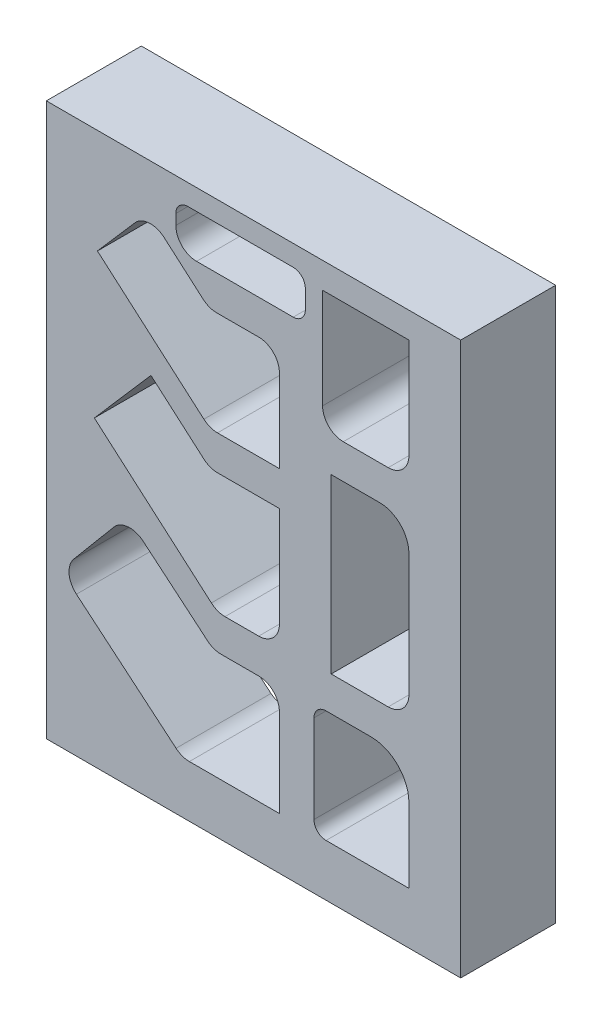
ISO-10303-21;
HEADER;
FILE_DESCRIPTION(('STEP AP214'),'2;1');
FILE_NAME('part.step','',(''),(''),'','','');
FILE_SCHEMA(('AUTOMOTIVE_DESIGN { 1 0 10303 214 1 1 1 1 }'));
ENDSEC;
DATA;
#1=APPLICATION_CONTEXT('core data for automotive mechanical design processes');
#2=APPLICATION_PROTOCOL_DEFINITION('international standard','automotive_design',2000,#1);
#3=PRODUCT_CONTEXT('',#1,'mechanical');
#4=PRODUCT('Part','Part','',(#3));
#5=PRODUCT_RELATED_PRODUCT_CATEGORY('part','',(#4));
#6=PRODUCT_DEFINITION_FORMATION('','',#4);
#7=PRODUCT_DEFINITION_CONTEXT('part definition',#1,'design');
#8=PRODUCT_DEFINITION('design','',#6,#7);
#9=PRODUCT_DEFINITION_SHAPE('','',#8);
#10=(LENGTH_UNIT() NAMED_UNIT(*) SI_UNIT(.MILLI.,.METRE.));
#11=(NAMED_UNIT(*) PLANE_ANGLE_UNIT() SI_UNIT($,.RADIAN.));
#12=(NAMED_UNIT(*) SI_UNIT($,.STERADIAN.) SOLID_ANGLE_UNIT());
#13=UNCERTAINTY_MEASURE_WITH_UNIT(LENGTH_MEASURE(1.E-05),#10,'distance_accuracy_value','');
#14=(GEOMETRIC_REPRESENTATION_CONTEXT(3) GLOBAL_UNCERTAINTY_ASSIGNED_CONTEXT((#13)) GLOBAL_UNIT_ASSIGNED_CONTEXT((#10,
#11,#12)) REPRESENTATION_CONTEXT('',''));
#15=CARTESIAN_POINT('',(0.,0.,0.));
#16=DIRECTION('',(0.,0.,1.));
#17=DIRECTION('',(1.,0.,0.));
#18=AXIS2_PLACEMENT_3D('',#15,#16,#17);
#19=CARTESIAN_POINT('',(0.,0.,34.925));
#20=DIRECTION('',(0.,0.,1.));
#21=DIRECTION('',(1.,0.,0.));
#22=AXIS2_PLACEMENT_3D('',#19,#20,#21);
#23=PLANE('',#22);
#24=DIRECTION('',(0.,1.,0.));
#25=VECTOR('',#24,1.);
#26=CARTESIAN_POINT('',(19.05,-19.05,34.925));
#27=LINE('',#26,#25);
#28=CARTESIAN_POINT('',(19.05,-19.05,34.925));
#29=VERTEX_POINT('',#28);
#30=CARTESIAN_POINT('',(19.05,184.15,34.925));
#31=VERTEX_POINT('',#30);
#32=EDGE_CURVE('E1025',#29,#31,#27,.T.);
#33=ORIENTED_EDGE('',*,*,#32,.T.);
#34=DIRECTION('',(-1.,0.,0.));
#35=VECTOR('',#34,1.);
#36=CARTESIAN_POINT('',(19.05,184.15,34.925));
#37=LINE('',#36,#35);
#38=CARTESIAN_POINT('',(-133.35,184.15,34.925));
#39=VERTEX_POINT('',#38);
#40=EDGE_CURVE('E1029',#31,#39,#37,.T.);
#41=ORIENTED_EDGE('',*,*,#40,.T.);
#42=DIRECTION('',(0.,-1.,0.));
#43=VECTOR('',#42,1.);
#44=CARTESIAN_POINT('',(-133.35,-19.05,34.925));
#45=LINE('',#44,#43);
#46=CARTESIAN_POINT('',(-133.35,-19.05,34.925));
#47=VERTEX_POINT('',#46);
#48=EDGE_CURVE('E1033',#39,#47,#45,.T.);
#49=ORIENTED_EDGE('',*,*,#48,.T.);
#50=DIRECTION('',(1.,0.,0.));
#51=VECTOR('',#50,1.);
#52=CARTESIAN_POINT('',(19.05,-19.05,34.925));
#53=LINE('',#52,#51);
#54=EDGE_CURVE('E1036',#47,#29,#53,.T.);
#55=ORIENTED_EDGE('',*,*,#54,.T.);
#56=EDGE_LOOP('',(#33,#41,#49,#55));
#57=FACE_BOUND('',#56,.T.);
#58=DIRECTION('',(0.755030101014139,-0.65569012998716,0.));
#59=VECTOR('',#58,1.);
#60=CARTESIAN_POINT('',(-115.699075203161,91.9574631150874,34.925));
#61=LINE('',#60,#59);
#62=CARTESIAN_POINT('',(-115.699075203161,91.9574631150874,34.925));
#63=VERTEX_POINT('',#62);
#64=CARTESIAN_POINT('',(-72.6491688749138,54.5716706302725,34.925));
#65=VERTEX_POINT('',#64);
#66=EDGE_CURVE('E935',#63,#65,#61,.T.);
#67=ORIENTED_EDGE('',*,*,#66,.F.);
#68=DIRECTION('',(-0.655690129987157,-0.755030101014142,0.));
#69=VECTOR('',#68,1.);
#70=CARTESIAN_POINT('',(-94.8809135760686,115.929668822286,34.925));
#71=LINE('',#70,#69);
#72=CARTESIAN_POINT('',(-94.8809135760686,115.929668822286,34.925));
#73=VERTEX_POINT('',#72);
#74=EDGE_CURVE('E932',#73,#63,#71,.T.);
#75=ORIENTED_EDGE('',*,*,#74,.F.);
#76=DIRECTION('',(-0.755030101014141,0.655690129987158,0.));
#77=VECTOR('',#76,1.);
#78=CARTESIAN_POINT('',(-75.4112784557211,99.0216706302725,34.925));
#79=LINE('',#78,#77);
#80=CARTESIAN_POINT('',(-75.4112784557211,99.0216706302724,34.925));
#81=VERTEX_POINT('',#80);
#82=EDGE_CURVE('E958',#81,#73,#79,.T.);
#83=ORIENTED_EDGE('',*,*,#82,.F.);
#84=CARTESIAN_POINT('',(-70.4149196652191,104.775,34.925));
#85=DIRECTION('',(0.,0.,-1.));
#86=DIRECTION('',(1.,0.,0.));
#87=AXIS2_PLACEMENT_3D('',#84,#85,#86);
#88=CIRCLE('',#87,7.61999999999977);
#89=CARTESIAN_POINT('',(-70.4149196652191,97.1550000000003,34.925));
#90=VERTEX_POINT('',#89);
#91=EDGE_CURVE('E954',#90,#81,#88,.T.);
#92=ORIENTED_EDGE('',*,*,#91,.F.);
#93=DIRECTION('',(-1.,0.,0.));
#94=VECTOR('',#93,1.);
#95=CARTESIAN_POINT('',(-47.625,97.1550000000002,34.925));
#96=LINE('',#95,#94);
#97=CARTESIAN_POINT('',(-47.625,97.1550000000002,34.925));
#98=VERTEX_POINT('',#97);
#99=EDGE_CURVE('E951',#98,#90,#96,.T.);
#100=ORIENTED_EDGE('',*,*,#99,.F.);
#101=DIRECTION('',(0.,1.,0.));
#102=VECTOR('',#101,1.);
#103=CARTESIAN_POINT('',(-47.625,60.3250000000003,34.925));
#104=LINE('',#103,#102);
#105=CARTESIAN_POINT('',(-47.625,60.3250000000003,34.925));
#106=VERTEX_POINT('',#105);
#107=EDGE_CURVE('E948',#106,#98,#104,.T.);
#108=ORIENTED_EDGE('',*,*,#107,.F.);
#109=CARTESIAN_POINT('',(-55.245,60.3250000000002,34.925));
#110=DIRECTION('',(0.,0.,1.));
#111=DIRECTION('',(1.,0.,0.));
#112=AXIS2_PLACEMENT_3D('',#109,#110,#111);
#113=CIRCLE('',#112,7.61999999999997);
#114=CARTESIAN_POINT('',(-55.2450000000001,52.7050000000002,34.925));
#115=VERTEX_POINT('',#114);
#116=EDGE_CURVE('E945',#115,#106,#113,.T.);
#117=ORIENTED_EDGE('',*,*,#116,.F.);
#118=DIRECTION('',(1.,0.,0.));
#119=VECTOR('',#118,1.);
#120=CARTESIAN_POINT('',(-67.6528100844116,52.7050000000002,34.925));
#121=LINE('',#120,#119);
#122=CARTESIAN_POINT('',(-67.6528100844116,52.7050000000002,34.925));
#123=VERTEX_POINT('',#122);
#124=EDGE_CURVE('E942',#123,#115,#121,.T.);
#125=ORIENTED_EDGE('',*,*,#124,.F.);
#126=CARTESIAN_POINT('',(-67.6528100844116,60.3250000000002,34.925));
#127=DIRECTION('',(0.,0.,1.));
#128=DIRECTION('',(1.,0.,0.));
#129=AXIS2_PLACEMENT_3D('',#126,#127,#128);
#130=CIRCLE('',#129,7.61999999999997);
#131=EDGE_CURVE('E939',#65,#123,#130,.T.);
#132=ORIENTED_EDGE('',*,*,#131,.F.);
#133=EDGE_LOOP('',(#67,#75,#83,#92,#100,#108,#117,#125,#132));
#134=FACE_BOUND('',#133,.T.);
#135=DIRECTION('',(-1.,0.,0.));
#136=VECTOR('',#135,1.);
#137=CARTESIAN_POINT('',(-55.245,40.0050000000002,34.925));
#138=LINE('',#137,#136);
#139=CARTESIAN_POINT('',(-55.245,40.0050000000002,34.925));
#140=VERTEX_POINT('',#139);
#141=CARTESIAN_POINT('',(-69.1477919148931,40.0050000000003,34.925));
#142=VERTEX_POINT('',#141);
#143=EDGE_CURVE('E822',#140,#142,#138,.T.);
#144=ORIENTED_EDGE('',*,*,#143,.F.);
#145=CARTESIAN_POINT('',(-55.245,32.3850000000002,34.925));
#146=DIRECTION('',(0.,0.,1.));
#147=DIRECTION('',(1.,0.,0.));
#148=AXIS2_PLACEMENT_3D('',#145,#146,#147);
#149=CIRCLE('',#148,7.61999999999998);
#150=CARTESIAN_POINT('',(-47.625,32.3850000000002,34.925));
#151=VERTEX_POINT('',#150);
#152=EDGE_CURVE('E819',#151,#140,#149,.T.);
#153=ORIENTED_EDGE('',*,*,#152,.F.);
#154=DIRECTION('',(0.,1.,0.));
#155=VECTOR('',#154,1.);
#156=CARTESIAN_POINT('',(-47.625,1.11022302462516E-13,34.925));
#157=LINE('',#156,#155);
#158=CARTESIAN_POINT('',(-47.625,1.11022305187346E-13,34.925));
#159=VERTEX_POINT('',#158);
#160=EDGE_CURVE('E851',#159,#151,#157,.T.);
#161=ORIENTED_EDGE('',*,*,#160,.F.);
#162=DIRECTION('',(1.,0.,0.));
#163=VECTOR('',#162,1.);
#164=CARTESIAN_POINT('',(-80.7447672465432,1.02348685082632E-13,34.925));
#165=LINE('',#164,#163);
#166=CARTESIAN_POINT('',(-80.7447672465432,1.02348685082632E-13,34.925));
#167=VERTEX_POINT('',#166);
#168=EDGE_CURVE('E847',#167,#159,#165,.T.);
#169=ORIENTED_EDGE('',*,*,#168,.F.);
#170=CARTESIAN_POINT('',(-80.7447672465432,7.62000000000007,34.925));
#171=DIRECTION('',(0.,0.,1.));
#172=DIRECTION('',(1.,0.,0.));
#173=AXIS2_PLACEMENT_3D('',#170,#171,#172);
#174=CIRCLE('',#173,7.61999999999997);
#175=CARTESIAN_POINT('',(-85.6428088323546,1.78274134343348,34.925));
#176=VERTEX_POINT('',#175);
#177=EDGE_CURVE('E844',#176,#167,#174,.T.);
#178=ORIENTED_EDGE('',*,*,#177,.F.);
#179=DIRECTION('',(0.766044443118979,-0.642787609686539,0.));
#180=VECTOR('',#179,1.);
#181=CARTESIAN_POINT('',(-122.287115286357,32.5309653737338,34.925));
#182=LINE('',#181,#180);
#183=CARTESIAN_POINT('',(-122.287115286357,32.5309653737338,34.925));
#184=VERTEX_POINT('',#183);
#185=EDGE_CURVE('E841',#184,#176,#182,.T.);
#186=ORIENTED_EDGE('',*,*,#185,.F.);
#187=CARTESIAN_POINT('',(-117.389073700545,38.3682240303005,34.925));
#188=DIRECTION('',(0.,0.,1.));
#189=DIRECTION('',(1.,0.,0.));
#190=AXIS2_PLACEMENT_3D('',#187,#188,#189);
#191=CIRCLE('',#190,7.62000000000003);
#192=CARTESIAN_POINT('',(-123.226332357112,43.2662656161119,34.925));
#193=VERTEX_POINT('',#192);
#194=EDGE_CURVE('E838',#193,#184,#191,.T.);
#195=ORIENTED_EDGE('',*,*,#194,.F.);
#196=DIRECTION('',(-0.642787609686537,-0.76604444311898,0.));
#197=VECTOR('',#196,1.);
#198=CARTESIAN_POINT('',(-108.532207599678,60.7780415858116,34.925));
#199=LINE('',#198,#197);
#200=CARTESIAN_POINT('',(-108.532207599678,60.7780415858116,34.925));
#201=VERTEX_POINT('',#200);
#202=EDGE_CURVE('E835',#201,#193,#199,.T.);
#203=ORIENTED_EDGE('',*,*,#202,.F.);
#204=CARTESIAN_POINT('',(-102.694948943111,55.8800000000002,34.925));
#205=DIRECTION('',(0.,0.,1.));
#206=DIRECTION('',(1.,0.,0.));
#207=AXIS2_PLACEMENT_3D('',#204,#205,#206);
#208=CIRCLE('',#207,7.62000000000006);
#209=CARTESIAN_POINT('',(-97.7969073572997,61.7172586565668,34.925));
#210=VERTEX_POINT('',#209);
#211=EDGE_CURVE('E832',#210,#201,#208,.T.);
#212=ORIENTED_EDGE('',*,*,#211,.F.);
#213=DIRECTION('',(-0.766044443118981,0.642787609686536,0.));
#214=VECTOR('',#213,1.);
#215=CARTESIAN_POINT('',(-74.0458335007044,41.7877413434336,34.925));
#216=LINE('',#215,#214);
#217=CARTESIAN_POINT('',(-74.0458335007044,41.7877413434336,34.925));
#218=VERTEX_POINT('',#217);
#219=EDGE_CURVE('E829',#218,#210,#216,.T.);
#220=ORIENTED_EDGE('',*,*,#219,.F.);
#221=CARTESIAN_POINT('',(-69.1477919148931,47.6250000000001,34.925));
#222=DIRECTION('',(0.,0.,-1.));
#223=DIRECTION('',(1.,0.,0.));
#224=AXIS2_PLACEMENT_3D('',#221,#222,#223);
#225=CIRCLE('',#224,7.61999999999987);
#226=EDGE_CURVE('E826',#142,#218,#225,.T.);
#227=ORIENTED_EDGE('',*,*,#226,.F.);
#228=EDGE_LOOP('',(#144,#153,#161,#169,#178,#186,#195,#203,#212,#220,#227));
#229=FACE_BOUND('',#228,.T.);
#230=DIRECTION('',(-1.,0.,0.));
#231=VECTOR('',#230,1.);
#232=CARTESIAN_POINT('',(-13.97,41.2749999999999,34.925));
#233=LINE('',#232,#231);
#234=CARTESIAN_POINT('',(-13.97,41.2749999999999,34.925));
#235=VERTEX_POINT('',#234);
#236=CARTESIAN_POINT('',(-30.48,41.2749999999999,34.925));
#237=VERTEX_POINT('',#236);
#238=EDGE_CURVE('E749',#235,#237,#233,.T.);
#239=ORIENTED_EDGE('',*,*,#238,.F.);
#240=CARTESIAN_POINT('',(-13.97,27.3049999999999,34.925));
#241=DIRECTION('',(0.,0.,1.));
#242=DIRECTION('',(1.,0.,0.));
#243=AXIS2_PLACEMENT_3D('',#240,#241,#242);
#244=CIRCLE('',#243,13.97);
#245=CARTESIAN_POINT('',(0.,27.3049999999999,34.925));
#246=VERTEX_POINT('',#245);
#247=EDGE_CURVE('E746',#246,#235,#244,.T.);
#248=ORIENTED_EDGE('',*,*,#247,.F.);
#249=DIRECTION('',(0.,1.,0.));
#250=VECTOR('',#249,1.);
#251=CARTESIAN_POINT('',(0.,0.,34.925));
#252=LINE('',#251,#250);
#253=CARTESIAN_POINT('',(0.,0.,34.925));
#254=VERTEX_POINT('',#253);
#255=EDGE_CURVE('E766',#254,#246,#252,.T.);
#256=ORIENTED_EDGE('',*,*,#255,.F.);
#257=DIRECTION('',(1.,0.,0.));
#258=VECTOR('',#257,1.);
#259=CARTESIAN_POINT('',(-30.48,0.,34.925));
#260=LINE('',#259,#258);
#261=CARTESIAN_POINT('',(-30.48,0.,34.925));
#262=VERTEX_POINT('',#261);
#263=EDGE_CURVE('E762',#262,#254,#260,.T.);
#264=ORIENTED_EDGE('',*,*,#263,.F.);
#265=CARTESIAN_POINT('',(-30.48,4.44500000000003,34.925));
#266=DIRECTION('',(0.,0.,1.));
#267=DIRECTION('',(1.,0.,0.));
#268=AXIS2_PLACEMENT_3D('',#265,#266,#267);
#269=CIRCLE('',#268,4.44500000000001);
#270=CARTESIAN_POINT('',(-34.925,4.44500000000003,34.925));
#271=VERTEX_POINT('',#270);
#272=EDGE_CURVE('E759',#271,#262,#269,.T.);
#273=ORIENTED_EDGE('',*,*,#272,.F.);
#274=DIRECTION('',(0.,-1.,0.));
#275=VECTOR('',#274,1.);
#276=CARTESIAN_POINT('',(-34.925,36.8299999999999,34.925));
#277=LINE('',#276,#275);
#278=CARTESIAN_POINT('',(-34.925,36.8299999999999,34.925));
#279=VERTEX_POINT('',#278);
#280=EDGE_CURVE('E756',#279,#271,#277,.T.);
#281=ORIENTED_EDGE('',*,*,#280,.F.);
#282=CARTESIAN_POINT('',(-30.48,36.8299999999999,34.925));
#283=DIRECTION('',(0.,0.,1.));
#284=DIRECTION('',(1.,0.,0.));
#285=AXIS2_PLACEMENT_3D('',#282,#283,#284);
#286=CIRCLE('',#285,4.44500000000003);
#287=EDGE_CURVE('E753',#237,#279,#286,.T.);
#288=ORIENTED_EDGE('',*,*,#287,.F.);
#289=EDGE_LOOP('',(#239,#248,#256,#264,#273,#281,#288));
#290=FACE_BOUND('',#289,.T.);
#291=DIRECTION('',(-1.,0.,0.));
#292=VECTOR('',#291,1.);
#293=CARTESIAN_POINT('',(-10.7949999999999,117.475,34.925));
#294=LINE('',#293,#292);
#295=CARTESIAN_POINT('',(-10.7949999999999,117.475,34.925));
#296=VERTEX_POINT('',#295);
#297=CARTESIAN_POINT('',(-28.575,117.475,34.925));
#298=VERTEX_POINT('',#297);
#299=EDGE_CURVE('E686',#296,#298,#294,.T.);
#300=ORIENTED_EDGE('',*,*,#299,.F.);
#301=CARTESIAN_POINT('',(-10.7950000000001,106.68,34.925));
#302=DIRECTION('',(0.,0.,1.));
#303=DIRECTION('',(1.,0.,0.));
#304=AXIS2_PLACEMENT_3D('',#301,#302,#303);
#305=CIRCLE('',#304,10.795);
#306=CARTESIAN_POINT('',(0.,106.68,34.925));
#307=VERTEX_POINT('',#306);
#308=EDGE_CURVE('E683',#307,#296,#305,.T.);
#309=ORIENTED_EDGE('',*,*,#308,.F.);
#310=DIRECTION('',(0.,1.,0.));
#311=VECTOR('',#310,1.);
#312=CARTESIAN_POINT('',(0.,61.5950000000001,34.925));
#313=LINE('',#312,#311);
#314=CARTESIAN_POINT('',(0.,61.5950000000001,34.925));
#315=VERTEX_POINT('',#314);
#316=EDGE_CURVE('E700',#315,#307,#313,.T.);
#317=ORIENTED_EDGE('',*,*,#316,.F.);
#318=CARTESIAN_POINT('',(-7.62000000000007,61.5950000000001,34.925));
#319=DIRECTION('',(0.,0.,1.));
#320=DIRECTION('',(1.,0.,0.));
#321=AXIS2_PLACEMENT_3D('',#318,#319,#320);
#322=CIRCLE('',#321,7.61999999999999);
#323=CARTESIAN_POINT('',(-7.61999999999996,53.9750000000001,34.925));
#324=VERTEX_POINT('',#323);
#325=EDGE_CURVE('E696',#324,#315,#322,.T.);
#326=ORIENTED_EDGE('',*,*,#325,.F.);
#327=DIRECTION('',(1.,0.,0.));
#328=VECTOR('',#327,1.);
#329=CARTESIAN_POINT('',(-28.575,53.9750000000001,34.925));
#330=LINE('',#329,#328);
#331=CARTESIAN_POINT('',(-28.575,53.9750000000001,34.925));
#332=VERTEX_POINT('',#331);
#333=EDGE_CURVE('E693',#332,#324,#330,.T.);
#334=ORIENTED_EDGE('',*,*,#333,.F.);
#335=DIRECTION('',(0.,-1.,0.));
#336=VECTOR('',#335,1.);
#337=CARTESIAN_POINT('',(-28.575,117.475,34.925));
#338=LINE('',#337,#336);
#339=EDGE_CURVE('E690',#298,#332,#338,.T.);
#340=ORIENTED_EDGE('',*,*,#339,.F.);
#341=EDGE_LOOP('',(#300,#309,#317,#326,#334,#340));
#342=FACE_BOUND('',#341,.T.);
#343=DIRECTION('',(-1.,0.,0.));
#344=VECTOR('',#343,1.);
#345=CARTESIAN_POINT('',(-55.245,147.955,34.925));
#346=LINE('',#345,#344);
#347=CARTESIAN_POINT('',(-55.245,147.955,34.925));
#348=VERTEX_POINT('',#347);
#349=CARTESIAN_POINT('',(-70.7072023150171,147.955,34.925));
#350=VERTEX_POINT('',#349);
#351=EDGE_CURVE('E583',#348,#350,#346,.T.);
#352=ORIENTED_EDGE('',*,*,#351,.F.);
#353=CARTESIAN_POINT('',(-55.245,140.335,34.925));
#354=DIRECTION('',(0.,0.,1.));
#355=DIRECTION('',(1.,0.,0.));
#356=AXIS2_PLACEMENT_3D('',#353,#354,#355);
#357=CIRCLE('',#356,7.61999999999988);
#358=CARTESIAN_POINT('',(-47.6250000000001,140.335,34.925));
#359=VERTEX_POINT('',#358);
#360=EDGE_CURVE('E580',#359,#348,#357,.T.);
#361=ORIENTED_EDGE('',*,*,#360,.F.);
#362=DIRECTION('',(0.,1.,0.));
#363=VECTOR('',#362,1.);
#364=CARTESIAN_POINT('',(-47.625,109.855,34.925));
#365=LINE('',#364,#363);
#366=CARTESIAN_POINT('',(-47.625,109.855,34.925));
#367=VERTEX_POINT('',#366);
#368=EDGE_CURVE('E609',#367,#359,#365,.T.);
#369=ORIENTED_EDGE('',*,*,#368,.F.);
#370=DIRECTION('',(1.,0.,0.));
#371=VECTOR('',#370,1.);
#372=CARTESIAN_POINT('',(-70.4149196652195,109.855,34.925));
#373=LINE('',#372,#371);
#374=CARTESIAN_POINT('',(-70.4149196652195,109.855,34.925));
#375=VERTEX_POINT('',#374);
#376=EDGE_CURVE('E605',#375,#367,#373,.T.);
#377=ORIENTED_EDGE('',*,*,#376,.F.);
#378=CARTESIAN_POINT('',(-70.4149196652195,117.475,34.925));
#379=DIRECTION('',(0.,0.,1.));
#380=DIRECTION('',(1.,0.,0.));
#381=AXIS2_PLACEMENT_3D('',#378,#379,#380);
#382=CIRCLE('',#381,7.61999999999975);
#383=CARTESIAN_POINT('',(-75.4112784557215,111.721670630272,34.925));
#384=VERTEX_POINT('',#383);
#385=EDGE_CURVE('E602',#384,#375,#382,.T.);
#386=ORIENTED_EDGE('',*,*,#385,.F.);
#387=DIRECTION('',(0.75503010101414,-0.655690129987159,0.));
#388=VECTOR('',#387,1.);
#389=CARTESIAN_POINT('',(-114.560273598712,145.719798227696,34.925));
#390=LINE('',#389,#388);
#391=CARTESIAN_POINT('',(-114.560273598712,145.719798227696,34.925));
#392=VERTEX_POINT('',#391);
#393=EDGE_CURVE('E599',#392,#384,#390,.T.);
#394=ORIENTED_EDGE('',*,*,#393,.F.);
#395=DIRECTION('',(-0.655690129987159,-0.75503010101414,0.));
#396=VECTOR('',#395,1.);
#397=CARTESIAN_POINT('',(-100.820286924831,161.541453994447,34.925));
#398=LINE('',#397,#396);
#399=CARTESIAN_POINT('',(-100.820286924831,161.541453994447,34.925));
#400=VERTEX_POINT('',#399);
#401=EDGE_CURVE('E596',#400,#392,#398,.T.);
#402=ORIENTED_EDGE('',*,*,#401,.F.);
#403=CARTESIAN_POINT('',(-95.0669575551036,156.545095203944,34.925));
#404=DIRECTION('',(0.,0.,1.));
#405=DIRECTION('',(1.,0.,0.));
#406=AXIS2_PLACEMENT_3D('',#403,#404,#405);
#407=CIRCLE('',#406,7.61999999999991);
#408=CARTESIAN_POINT('',(-90.0705987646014,162.298424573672,34.925));
#409=VERTEX_POINT('',#408);
#410=EDGE_CURVE('E593',#409,#400,#407,.T.);
#411=ORIENTED_EDGE('',*,*,#410,.F.);
#412=DIRECTION('',(-0.755030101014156,0.655690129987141,0.));
#413=VECTOR('',#412,1.);
#414=CARTESIAN_POINT('',(-75.7035611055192,149.821670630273,34.925));
#415=LINE('',#414,#413);
#416=CARTESIAN_POINT('',(-75.7035611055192,149.821670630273,34.925));
#417=VERTEX_POINT('',#416);
#418=EDGE_CURVE('E590',#417,#409,#415,.T.);
#419=ORIENTED_EDGE('',*,*,#418,.F.);
#420=CARTESIAN_POINT('',(-70.7072023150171,155.575,34.925));
#421=DIRECTION('',(0.,0.,-1.));
#422=DIRECTION('',(1.,0.,0.));
#423=AXIS2_PLACEMENT_3D('',#420,#421,#422);
#424=CIRCLE('',#423,7.61999999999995);
#425=EDGE_CURVE('E587',#350,#417,#424,.T.);
#426=ORIENTED_EDGE('',*,*,#425,.F.);
#427=EDGE_LOOP('',(#352,#361,#369,#377,#386,#394,#402,#411,#419,#426));
#428=FACE_BOUND('',#427,.T.);
#429=DIRECTION('',(1.,0.,0.));
#430=VECTOR('',#429,1.);
#431=CARTESIAN_POINT('',(-24.13,130.175,34.925));
#432=LINE('',#431,#430);
#433=CARTESIAN_POINT('',(-24.13,130.175,34.925));
#434=VERTEX_POINT('',#433);
#435=CARTESIAN_POINT('',(-7.62000000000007,130.175,34.925));
#436=VERTEX_POINT('',#435);
#437=EDGE_CURVE('E520',#434,#436,#432,.T.);
#438=ORIENTED_EDGE('',*,*,#437,.F.);
#439=CARTESIAN_POINT('',(-24.13,137.795,34.925));
#440=DIRECTION('',(0.,0.,1.));
#441=DIRECTION('',(1.,0.,0.));
#442=AXIS2_PLACEMENT_3D('',#439,#440,#441);
#443=CIRCLE('',#442,7.62000000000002);
#444=CARTESIAN_POINT('',(-31.75,137.795,34.925));
#445=VERTEX_POINT('',#444);
#446=EDGE_CURVE('E517',#445,#434,#443,.T.);
#447=ORIENTED_EDGE('',*,*,#446,.F.);
#448=DIRECTION('',(0.,-1.,0.));
#449=VECTOR('',#448,1.);
#450=CARTESIAN_POINT('',(-31.7500000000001,174.625,34.925));
#451=LINE('',#450,#449);
#452=CARTESIAN_POINT('',(-31.7500000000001,174.625,34.925));
#453=VERTEX_POINT('',#452);
#454=EDGE_CURVE('E534',#453,#445,#451,.T.);
#455=ORIENTED_EDGE('',*,*,#454,.F.);
#456=DIRECTION('',(-1.,0.,0.));
#457=VECTOR('',#456,1.);
#458=CARTESIAN_POINT('',(0.,174.625,34.925));
#459=LINE('',#458,#457);
#460=CARTESIAN_POINT('',(0.,174.625,34.925));
#461=VERTEX_POINT('',#460);
#462=EDGE_CURVE('E530',#461,#453,#459,.T.);
#463=ORIENTED_EDGE('',*,*,#462,.F.);
#464=DIRECTION('',(0.,1.,0.));
#465=VECTOR('',#464,1.);
#466=CARTESIAN_POINT('',(0.,137.795,34.925));
#467=LINE('',#466,#465);
#468=CARTESIAN_POINT('',(0.,137.795,34.925));
#469=VERTEX_POINT('',#468);
#470=EDGE_CURVE('E527',#469,#461,#467,.T.);
#471=ORIENTED_EDGE('',*,*,#470,.F.);
#472=CARTESIAN_POINT('',(-7.61999999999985,137.795,34.925));
#473=DIRECTION('',(0.,0.,1.));
#474=DIRECTION('',(1.,0.,0.));
#475=AXIS2_PLACEMENT_3D('',#472,#473,#474);
#476=CIRCLE('',#475,7.61999999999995);
#477=EDGE_CURVE('E524',#436,#469,#476,.T.);
#478=ORIENTED_EDGE('',*,*,#477,.F.);
#479=EDGE_LOOP('',(#438,#447,#455,#463,#471,#478));
#480=FACE_BOUND('',#479,.T.);
#481=DIRECTION('',(1.,0.,0.));
#482=VECTOR('',#481,1.);
#483=CARTESIAN_POINT('',(-78.1049999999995,160.655,34.925));
#484=LINE('',#483,#482);
#485=CARTESIAN_POINT('',(-78.1049999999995,160.655,34.925));
#486=VERTEX_POINT('',#485);
#487=CARTESIAN_POINT('',(-42.5449999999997,160.655,34.925));
#488=VERTEX_POINT('',#487);
#489=EDGE_CURVE('E436',#486,#488,#484,.T.);
#490=ORIENTED_EDGE('',*,*,#489,.F.);
#491=CARTESIAN_POINT('',(-78.1049999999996,168.275,34.925));
#492=DIRECTION('',(0.,0.,1.));
#493=DIRECTION('',(1.,0.,0.));
#494=AXIS2_PLACEMENT_3D('',#491,#492,#493);
#495=CIRCLE('',#494,7.62000000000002);
#496=CARTESIAN_POINT('',(-85.7249999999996,168.275,34.925));
#497=VERTEX_POINT('',#496);
#498=EDGE_CURVE('E427',#497,#486,#495,.T.);
#499=ORIENTED_EDGE('',*,*,#498,.F.);
#500=DIRECTION('',(0.,-1.,0.));
#501=VECTOR('',#500,1.);
#502=CARTESIAN_POINT('',(-85.7249999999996,172.085,34.925));
#503=LINE('',#502,#501);
#504=CARTESIAN_POINT('',(-85.7249999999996,172.085,34.925));
#505=VERTEX_POINT('',#504);
#506=EDGE_CURVE('E469',#505,#497,#503,.T.);
#507=ORIENTED_EDGE('',*,*,#506,.F.);
#508=CARTESIAN_POINT('',(-81.2799999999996,172.085,34.925));
#509=DIRECTION('',(0.,0.,1.));
#510=DIRECTION('',(1.,0.,0.));
#511=AXIS2_PLACEMENT_3D('',#508,#509,#510);
#512=CIRCLE('',#511,4.44500000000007);
#513=CARTESIAN_POINT('',(-81.2799999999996,176.53,34.925));
#514=VERTEX_POINT('',#513);
#515=EDGE_CURVE('E466',#514,#505,#512,.T.);
#516=ORIENTED_EDGE('',*,*,#515,.F.);
#517=DIRECTION('',(-1.,0.,0.));
#518=VECTOR('',#517,1.);
#519=CARTESIAN_POINT('',(-42.5449999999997,176.53,34.925));
#520=LINE('',#519,#518);
#521=CARTESIAN_POINT('',(-42.5449999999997,176.53,34.925));
#522=VERTEX_POINT('',#521);
#523=EDGE_CURVE('E463',#522,#514,#520,.T.);
#524=ORIENTED_EDGE('',*,*,#523,.F.);
#525=CARTESIAN_POINT('',(-42.5449999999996,172.085,34.925));
#526=DIRECTION('',(0.,0.,1.));
#527=DIRECTION('',(1.,0.,0.));
#528=AXIS2_PLACEMENT_3D('',#525,#526,#527);
#529=CIRCLE('',#528,4.44500000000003);
#530=CARTESIAN_POINT('',(-38.0999999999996,172.085,34.925));
#531=VERTEX_POINT('',#530);
#532=EDGE_CURVE('E460',#531,#522,#529,.T.);
#533=ORIENTED_EDGE('',*,*,#532,.F.);
#534=DIRECTION('',(0.,1.,0.));
#535=VECTOR('',#534,1.);
#536=CARTESIAN_POINT('',(-38.0999999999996,165.1,34.925));
#537=LINE('',#536,#535);
#538=CARTESIAN_POINT('',(-38.0999999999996,165.1,34.925));
#539=VERTEX_POINT('',#538);
#540=EDGE_CURVE('E455',#539,#531,#537,.T.);
#541=ORIENTED_EDGE('',*,*,#540,.F.);
#542=CARTESIAN_POINT('',(-42.5449999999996,165.1,34.925));
#543=DIRECTION('',(0.,0.,1.));
#544=DIRECTION('',(1.,0.,0.));
#545=AXIS2_PLACEMENT_3D('',#542,#543,#544);
#546=CIRCLE('',#545,4.44499999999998);
#547=EDGE_CURVE('E450',#488,#539,#546,.T.);
#548=ORIENTED_EDGE('',*,*,#547,.F.);
#549=EDGE_LOOP('',(#490,#499,#507,#516,#524,#533,#541,#548));
#550=FACE_BOUND('',#549,.T.);
#551=ADVANCED_FACE('F43',(#57,#134,#229,#290,#342,#428,#480,#550),#23,.T.);
#552=CARTESIAN_POINT('',(0.,0.,0.));
#553=DIRECTION('',(0.,0.,1.));
#554=DIRECTION('',(1.,0.,0.));
#555=AXIS2_PLACEMENT_3D('',#552,#553,#554);
#556=PLANE('',#555);
#557=CARTESIAN_POINT('',(-24.13,137.795,0.));
#558=DIRECTION('',(0.,0.,1.));
#559=DIRECTION('',(1.,0.,0.));
#560=AXIS2_PLACEMENT_3D('',#557,#558,#559);
#561=CIRCLE('',#560,7.62000000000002);
#562=CARTESIAN_POINT('',(-31.75,137.795,0.));
#563=VERTEX_POINT('',#562);
#564=CARTESIAN_POINT('',(-24.13,130.175,0.));
#565=VERTEX_POINT('',#564);
#566=EDGE_CURVE('E445',#563,#565,#561,.T.);
#567=ORIENTED_EDGE('',*,*,#566,.T.);
#568=DIRECTION('',(1.,0.,0.));
#569=VECTOR('',#568,1.);
#570=CARTESIAN_POINT('',(-24.13,130.175,0.));
#571=LINE('',#570,#569);
#572=CARTESIAN_POINT('',(-7.62000000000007,130.175,0.));
#573=VERTEX_POINT('',#572);
#574=EDGE_CURVE('E541',#565,#573,#571,.T.);
#575=ORIENTED_EDGE('',*,*,#574,.T.);
#576=CARTESIAN_POINT('',(-7.61999999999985,137.795,0.));
#577=DIRECTION('',(0.,0.,1.));
#578=DIRECTION('',(1.,0.,0.));
#579=AXIS2_PLACEMENT_3D('',#576,#577,#578);
#580=CIRCLE('',#579,7.61999999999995);
#581=CARTESIAN_POINT('',(0.,137.795,0.));
#582=VERTEX_POINT('',#581);
#583=EDGE_CURVE('E545',#573,#582,#580,.T.);
#584=ORIENTED_EDGE('',*,*,#583,.T.);
#585=DIRECTION('',(0.,1.,0.));
#586=VECTOR('',#585,1.);
#587=CARTESIAN_POINT('',(0.,137.795,0.));
#588=LINE('',#587,#586);
#589=CARTESIAN_POINT('',(0.,174.625,0.));
#590=VERTEX_POINT('',#589);
#591=EDGE_CURVE('E549',#582,#590,#588,.T.);
#592=ORIENTED_EDGE('',*,*,#591,.T.);
#593=DIRECTION('',(-1.,0.,0.));
#594=VECTOR('',#593,1.);
#595=CARTESIAN_POINT('',(0.,174.625,0.));
#596=LINE('',#595,#594);
#597=CARTESIAN_POINT('',(-31.7500000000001,174.625,0.));
#598=VERTEX_POINT('',#597);
#599=EDGE_CURVE('E553',#590,#598,#596,.T.);
#600=ORIENTED_EDGE('',*,*,#599,.T.);
#601=DIRECTION('',(0.,-1.,0.));
#602=VECTOR('',#601,1.);
#603=CARTESIAN_POINT('',(-31.7500000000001,174.625,0.));
#604=LINE('',#603,#602);
#605=EDGE_CURVE('E521',#598,#563,#604,.T.);
#606=ORIENTED_EDGE('',*,*,#605,.T.);
#607=EDGE_LOOP('',(#567,#575,#584,#592,#600,#606));
#608=FACE_BOUND('',#607,.T.);
#609=CARTESIAN_POINT('',(-10.7950000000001,106.68,0.));
#610=DIRECTION('',(0.,0.,1.));
#611=DIRECTION('',(1.,0.,0.));
#612=AXIS2_PLACEMENT_3D('',#609,#610,#611);
#613=CIRCLE('',#612,10.795);
#614=CARTESIAN_POINT('',(0.,106.68,0.));
#615=VERTEX_POINT('',#614);
#616=CARTESIAN_POINT('',(-10.7949999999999,117.475,0.));
#617=VERTEX_POINT('',#616);
#618=EDGE_CURVE('E682',#615,#617,#613,.T.);
#619=ORIENTED_EDGE('',*,*,#618,.T.);
#620=DIRECTION('',(-1.,0.,0.));
#621=VECTOR('',#620,1.);
#622=CARTESIAN_POINT('',(-10.7949999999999,117.475,0.));
#623=LINE('',#622,#621);
#624=CARTESIAN_POINT('',(-28.575,117.475,0.));
#625=VERTEX_POINT('',#624);
#626=EDGE_CURVE('E707',#617,#625,#623,.T.);
#627=ORIENTED_EDGE('',*,*,#626,.T.);
#628=DIRECTION('',(0.,-1.,0.));
#629=VECTOR('',#628,1.);
#630=CARTESIAN_POINT('',(-28.575,117.475,0.));
#631=LINE('',#630,#629);
#632=CARTESIAN_POINT('',(-28.575,53.9750000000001,0.));
#633=VERTEX_POINT('',#632);
#634=EDGE_CURVE('E711',#625,#633,#631,.T.);
#635=ORIENTED_EDGE('',*,*,#634,.T.);
#636=DIRECTION('',(1.,0.,0.));
#637=VECTOR('',#636,1.);
#638=CARTESIAN_POINT('',(-28.575,53.9750000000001,0.));
#639=LINE('',#638,#637);
#640=CARTESIAN_POINT('',(-7.61999999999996,53.9750000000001,0.));
#641=VERTEX_POINT('',#640);
#642=EDGE_CURVE('E715',#633,#641,#639,.T.);
#643=ORIENTED_EDGE('',*,*,#642,.T.);
#644=CARTESIAN_POINT('',(-7.62000000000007,61.5950000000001,0.));
#645=DIRECTION('',(0.,0.,1.));
#646=DIRECTION('',(1.,0.,0.));
#647=AXIS2_PLACEMENT_3D('',#644,#645,#646);
#648=CIRCLE('',#647,7.61999999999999);
#649=CARTESIAN_POINT('',(0.,61.5950000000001,0.));
#650=VERTEX_POINT('',#649);
#651=EDGE_CURVE('E719',#641,#650,#648,.T.);
#652=ORIENTED_EDGE('',*,*,#651,.T.);
#653=DIRECTION('',(0.,1.,0.));
#654=VECTOR('',#653,1.);
#655=CARTESIAN_POINT('',(0.,61.5950000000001,0.));
#656=LINE('',#655,#654);
#657=EDGE_CURVE('E687',#650,#615,#656,.T.);
#658=ORIENTED_EDGE('',*,*,#657,.T.);
#659=EDGE_LOOP('',(#619,#627,#635,#643,#652,#658));
#660=FACE_BOUND('',#659,.T.);
#661=CARTESIAN_POINT('',(-55.245,32.3850000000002,0.));
#662=DIRECTION('',(0.,0.,1.));
#663=DIRECTION('',(1.,0.,0.));
#664=AXIS2_PLACEMENT_3D('',#661,#662,#663);
#665=CIRCLE('',#664,7.61999999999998);
#666=CARTESIAN_POINT('',(-47.625,32.3850000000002,0.));
#667=VERTEX_POINT('',#666);
#668=CARTESIAN_POINT('',(-55.245,40.0050000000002,0.));
#669=VERTEX_POINT('',#668);
#670=EDGE_CURVE('E818',#667,#669,#665,.T.);
#671=ORIENTED_EDGE('',*,*,#670,.T.);
#672=DIRECTION('',(-1.,0.,0.));
#673=VECTOR('',#672,1.);
#674=CARTESIAN_POINT('',(-55.245,40.0050000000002,0.));
#675=LINE('',#674,#673);
#676=CARTESIAN_POINT('',(-69.1477919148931,40.0050000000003,0.));
#677=VERTEX_POINT('',#676);
#678=EDGE_CURVE('E858',#669,#677,#675,.T.);
#679=ORIENTED_EDGE('',*,*,#678,.T.);
#680=CARTESIAN_POINT('',(-69.1477919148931,47.6250000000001,0.));
#681=DIRECTION('',(0.,0.,-1.));
#682=DIRECTION('',(1.,0.,0.));
#683=AXIS2_PLACEMENT_3D('',#680,#681,#682);
#684=CIRCLE('',#683,7.61999999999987);
#685=CARTESIAN_POINT('',(-74.0458335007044,41.7877413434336,0.));
#686=VERTEX_POINT('',#685);
#687=EDGE_CURVE('E862',#677,#686,#684,.T.);
#688=ORIENTED_EDGE('',*,*,#687,.T.);
#689=DIRECTION('',(-0.766044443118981,0.642787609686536,0.));
#690=VECTOR('',#689,1.);
#691=CARTESIAN_POINT('',(-74.0458335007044,41.7877413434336,0.));
#692=LINE('',#691,#690);
#693=CARTESIAN_POINT('',(-97.7969073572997,61.7172586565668,0.));
#694=VERTEX_POINT('',#693);
#695=EDGE_CURVE('E866',#686,#694,#692,.T.);
#696=ORIENTED_EDGE('',*,*,#695,.T.);
#697=CARTESIAN_POINT('',(-102.694948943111,55.8800000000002,0.));
#698=DIRECTION('',(0.,0.,1.));
#699=DIRECTION('',(1.,0.,0.));
#700=AXIS2_PLACEMENT_3D('',#697,#698,#699);
#701=CIRCLE('',#700,7.62000000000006);
#702=CARTESIAN_POINT('',(-108.532207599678,60.7780415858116,0.));
#703=VERTEX_POINT('',#702);
#704=EDGE_CURVE('E870',#694,#703,#701,.T.);
#705=ORIENTED_EDGE('',*,*,#704,.T.);
#706=DIRECTION('',(-0.642787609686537,-0.76604444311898,0.));
#707=VECTOR('',#706,1.);
#708=CARTESIAN_POINT('',(-108.532207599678,60.7780415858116,0.));
#709=LINE('',#708,#707);
#710=CARTESIAN_POINT('',(-123.226332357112,43.2662656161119,0.));
#711=VERTEX_POINT('',#710);
#712=EDGE_CURVE('E874',#703,#711,#709,.T.);
#713=ORIENTED_EDGE('',*,*,#712,.T.);
#714=CARTESIAN_POINT('',(-117.389073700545,38.3682240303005,0.));
#715=DIRECTION('',(0.,0.,1.));
#716=DIRECTION('',(1.,0.,0.));
#717=AXIS2_PLACEMENT_3D('',#714,#715,#716);
#718=CIRCLE('',#717,7.62000000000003);
#719=CARTESIAN_POINT('',(-122.287115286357,32.5309653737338,0.));
#720=VERTEX_POINT('',#719);
#721=EDGE_CURVE('E878',#711,#720,#718,.T.);
#722=ORIENTED_EDGE('',*,*,#721,.T.);
#723=DIRECTION('',(0.766044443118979,-0.642787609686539,0.));
#724=VECTOR('',#723,1.);
#725=CARTESIAN_POINT('',(-122.287115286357,32.5309653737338,0.));
#726=LINE('',#725,#724);
#727=CARTESIAN_POINT('',(-85.6428088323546,1.78274134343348,0.));
#728=VERTEX_POINT('',#727);
#729=EDGE_CURVE('E882',#720,#728,#726,.T.);
#730=ORIENTED_EDGE('',*,*,#729,.T.);
#731=CARTESIAN_POINT('',(-80.7447672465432,7.62000000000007,0.));
#732=DIRECTION('',(0.,0.,1.));
#733=DIRECTION('',(1.,0.,0.));
#734=AXIS2_PLACEMENT_3D('',#731,#732,#733);
#735=CIRCLE('',#734,7.61999999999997);
#736=CARTESIAN_POINT('',(-80.7447672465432,1.02348685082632E-13,0.));
#737=VERTEX_POINT('',#736);
#738=EDGE_CURVE('E886',#728,#737,#735,.T.);
#739=ORIENTED_EDGE('',*,*,#738,.T.);
#740=DIRECTION('',(1.,0.,0.));
#741=VECTOR('',#740,1.);
#742=CARTESIAN_POINT('',(-80.7447672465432,1.02348685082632E-13,0.));
#743=LINE('',#742,#741);
#744=CARTESIAN_POINT('',(-47.625,1.11022302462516E-13,0.));
#745=VERTEX_POINT('',#744);
#746=EDGE_CURVE('E890',#737,#745,#743,.T.);
#747=ORIENTED_EDGE('',*,*,#746,.T.);
#748=DIRECTION('',(0.,1.,0.));
#749=VECTOR('',#748,1.);
#750=CARTESIAN_POINT('',(-47.625,1.11022302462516E-13,0.));
#751=LINE('',#750,#749);
#752=EDGE_CURVE('E823',#745,#667,#751,.T.);
#753=ORIENTED_EDGE('',*,*,#752,.T.);
#754=EDGE_LOOP('',(#671,#679,#688,#696,#705,#713,#722,#730,#739,#747,#753));
#755=FACE_BOUND('',#754,.T.);
#756=DIRECTION('',(0.,1.,0.));
#757=VECTOR('',#756,1.);
#758=CARTESIAN_POINT('',(19.05,-19.05,0.));
#759=LINE('',#758,#757);
#760=CARTESIAN_POINT('',(19.05,-19.05,0.));
#761=VERTEX_POINT('',#760);
#762=CARTESIAN_POINT('',(19.05,184.15,0.));
#763=VERTEX_POINT('',#762);
#764=EDGE_CURVE('E1024',#761,#763,#759,.T.);
#765=ORIENTED_EDGE('',*,*,#764,.F.);
#766=DIRECTION('',(1.,0.,0.));
#767=VECTOR('',#766,1.);
#768=CARTESIAN_POINT('',(19.05,-19.05,0.));
#769=LINE('',#768,#767);
#770=CARTESIAN_POINT('',(-133.35,-19.05,0.));
#771=VERTEX_POINT('',#770);
#772=EDGE_CURVE('E1030',#771,#761,#769,.T.);
#773=ORIENTED_EDGE('',*,*,#772,.F.);
#774=DIRECTION('',(0.,-1.,0.));
#775=VECTOR('',#774,1.);
#776=CARTESIAN_POINT('',(-133.35,-19.05,0.));
#777=LINE('',#776,#775);
#778=CARTESIAN_POINT('',(-133.35,184.15,0.));
#779=VERTEX_POINT('',#778);
#780=EDGE_CURVE('E1046',#779,#771,#777,.T.);
#781=ORIENTED_EDGE('',*,*,#780,.F.);
#782=DIRECTION('',(-1.,0.,0.));
#783=VECTOR('',#782,1.);
#784=CARTESIAN_POINT('',(19.05,184.15,0.));
#785=LINE('',#784,#783);
#786=EDGE_CURVE('E1043',#763,#779,#785,.T.);
#787=ORIENTED_EDGE('',*,*,#786,.F.);
#788=EDGE_LOOP('',(#765,#773,#781,#787));
#789=FACE_BOUND('',#788,.T.);
#790=DIRECTION('',(-0.655690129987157,-0.755030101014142,0.));
#791=VECTOR('',#790,1.);
#792=CARTESIAN_POINT('',(-94.8809135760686,115.929668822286,0.));
#793=LINE('',#792,#791);
#794=CARTESIAN_POINT('',(-94.8809135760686,115.929668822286,0.));
#795=VERTEX_POINT('',#794);
#796=CARTESIAN_POINT('',(-115.699075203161,91.9574631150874,0.));
#797=VERTEX_POINT('',#796);
#798=EDGE_CURVE('E931',#795,#797,#793,.T.);
#799=ORIENTED_EDGE('',*,*,#798,.T.);
#800=DIRECTION('',(0.755030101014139,-0.65569012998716,0.));
#801=VECTOR('',#800,1.);
#802=CARTESIAN_POINT('',(-115.699075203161,91.9574631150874,0.));
#803=LINE('',#802,#801);
#804=CARTESIAN_POINT('',(-72.6491688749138,54.5716706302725,0.));
#805=VERTEX_POINT('',#804);
#806=EDGE_CURVE('E965',#797,#805,#803,.T.);
#807=ORIENTED_EDGE('',*,*,#806,.T.);
#808=CARTESIAN_POINT('',(-67.6528100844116,60.3250000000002,0.));
#809=DIRECTION('',(0.,0.,1.));
#810=DIRECTION('',(1.,0.,0.));
#811=AXIS2_PLACEMENT_3D('',#808,#809,#810);
#812=CIRCLE('',#811,7.61999999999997);
#813=CARTESIAN_POINT('',(-67.6528100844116,52.7050000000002,0.));
#814=VERTEX_POINT('',#813);
#815=EDGE_CURVE('E969',#805,#814,#812,.T.);
#816=ORIENTED_EDGE('',*,*,#815,.T.);
#817=DIRECTION('',(1.,0.,0.));
#818=VECTOR('',#817,1.);
#819=CARTESIAN_POINT('',(-67.6528100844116,52.7050000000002,0.));
#820=LINE('',#819,#818);
#821=CARTESIAN_POINT('',(-55.2450000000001,52.7050000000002,0.));
#822=VERTEX_POINT('',#821);
#823=EDGE_CURVE('E973',#814,#822,#820,.T.);
#824=ORIENTED_EDGE('',*,*,#823,.T.);
#825=CARTESIAN_POINT('',(-55.245,60.3250000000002,0.));
#826=DIRECTION('',(0.,0.,1.));
#827=DIRECTION('',(1.,0.,0.));
#828=AXIS2_PLACEMENT_3D('',#825,#826,#827);
#829=CIRCLE('',#828,7.61999999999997);
#830=CARTESIAN_POINT('',(-47.625,60.3250000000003,0.));
#831=VERTEX_POINT('',#830);
#832=EDGE_CURVE('E977',#822,#831,#829,.T.);
#833=ORIENTED_EDGE('',*,*,#832,.T.);
#834=DIRECTION('',(0.,1.,0.));
#835=VECTOR('',#834,1.);
#836=CARTESIAN_POINT('',(-47.625,60.3250000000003,0.));
#837=LINE('',#836,#835);
#838=CARTESIAN_POINT('',(-47.625,97.1550000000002,0.));
#839=VERTEX_POINT('',#838);
#840=EDGE_CURVE('E981',#831,#839,#837,.T.);
#841=ORIENTED_EDGE('',*,*,#840,.T.);
#842=DIRECTION('',(-1.,0.,0.));
#843=VECTOR('',#842,1.);
#844=CARTESIAN_POINT('',(-47.625,97.1550000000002,0.));
#845=LINE('',#844,#843);
#846=CARTESIAN_POINT('',(-70.4149196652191,97.1550000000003,0.));
#847=VERTEX_POINT('',#846);
#848=EDGE_CURVE('E985',#839,#847,#845,.T.);
#849=ORIENTED_EDGE('',*,*,#848,.T.);
#850=CARTESIAN_POINT('',(-70.4149196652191,104.775,0.));
#851=DIRECTION('',(0.,0.,-1.));
#852=DIRECTION('',(1.,0.,0.));
#853=AXIS2_PLACEMENT_3D('',#850,#851,#852);
#854=CIRCLE('',#853,7.61999999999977);
#855=CARTESIAN_POINT('',(-75.4112784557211,99.0216706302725,0.));
#856=VERTEX_POINT('',#855);
#857=EDGE_CURVE('E989',#847,#856,#854,.T.);
#858=ORIENTED_EDGE('',*,*,#857,.T.);
#859=DIRECTION('',(-0.755030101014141,0.655690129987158,0.));
#860=VECTOR('',#859,1.);
#861=CARTESIAN_POINT('',(-75.4112784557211,99.0216706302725,0.));
#862=LINE('',#861,#860);
#863=EDGE_CURVE('E936',#856,#795,#862,.T.);
#864=ORIENTED_EDGE('',*,*,#863,.T.);
#865=EDGE_LOOP('',(#799,#807,#816,#824,#833,#841,#849,#858,#864));
#866=FACE_BOUND('',#865,.T.);
#867=CARTESIAN_POINT('',(-13.97,27.3049999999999,0.));
#868=DIRECTION('',(0.,0.,1.));
#869=DIRECTION('',(1.,0.,0.));
#870=AXIS2_PLACEMENT_3D('',#867,#868,#869);
#871=CIRCLE('',#870,13.97);
#872=CARTESIAN_POINT('',(0.,27.3049999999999,0.));
#873=VERTEX_POINT('',#872);
#874=CARTESIAN_POINT('',(-13.97,41.2749999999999,0.));
#875=VERTEX_POINT('',#874);
#876=EDGE_CURVE('E745',#873,#875,#871,.T.);
#877=ORIENTED_EDGE('',*,*,#876,.T.);
#878=DIRECTION('',(-1.,0.,0.));
#879=VECTOR('',#878,1.);
#880=CARTESIAN_POINT('',(-13.97,41.2749999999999,0.));
#881=LINE('',#880,#879);
#882=CARTESIAN_POINT('',(-30.48,41.2749999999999,0.));
#883=VERTEX_POINT('',#882);
#884=EDGE_CURVE('E773',#875,#883,#881,.T.);
#885=ORIENTED_EDGE('',*,*,#884,.T.);
#886=CARTESIAN_POINT('',(-30.48,36.8299999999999,0.));
#887=DIRECTION('',(0.,0.,1.));
#888=DIRECTION('',(1.,0.,0.));
#889=AXIS2_PLACEMENT_3D('',#886,#887,#888);
#890=CIRCLE('',#889,4.44500000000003);
#891=CARTESIAN_POINT('',(-34.925,36.8299999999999,0.));
#892=VERTEX_POINT('',#891);
#893=EDGE_CURVE('E777',#883,#892,#890,.T.);
#894=ORIENTED_EDGE('',*,*,#893,.T.);
#895=DIRECTION('',(0.,-1.,0.));
#896=VECTOR('',#895,1.);
#897=CARTESIAN_POINT('',(-34.925,36.8299999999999,0.));
#898=LINE('',#897,#896);
#899=CARTESIAN_POINT('',(-34.925,4.44500000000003,0.));
#900=VERTEX_POINT('',#899);
#901=EDGE_CURVE('E781',#892,#900,#898,.T.);
#902=ORIENTED_EDGE('',*,*,#901,.T.);
#903=CARTESIAN_POINT('',(-30.48,4.44500000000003,0.));
#904=DIRECTION('',(0.,0.,1.));
#905=DIRECTION('',(1.,0.,0.));
#906=AXIS2_PLACEMENT_3D('',#903,#904,#905);
#907=CIRCLE('',#906,4.44500000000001);
#908=CARTESIAN_POINT('',(-30.48,0.,0.));
#909=VERTEX_POINT('',#908);
#910=EDGE_CURVE('E785',#900,#909,#907,.T.);
#911=ORIENTED_EDGE('',*,*,#910,.T.);
#912=DIRECTION('',(1.,0.,0.));
#913=VECTOR('',#912,1.);
#914=CARTESIAN_POINT('',(-30.48,0.,0.));
#915=LINE('',#914,#913);
#916=CARTESIAN_POINT('',(0.,0.,0.));
#917=VERTEX_POINT('',#916);
#918=EDGE_CURVE('E789',#909,#917,#915,.T.);
#919=ORIENTED_EDGE('',*,*,#918,.T.);
#920=DIRECTION('',(0.,1.,0.));
#921=VECTOR('',#920,1.);
#922=CARTESIAN_POINT('',(0.,0.,0.));
#923=LINE('',#922,#921);
#924=EDGE_CURVE('E750',#917,#873,#923,.T.);
#925=ORIENTED_EDGE('',*,*,#924,.T.);
#926=EDGE_LOOP('',(#877,#885,#894,#902,#911,#919,#925));
#927=FACE_BOUND('',#926,.T.);
#928=CARTESIAN_POINT('',(-55.245,140.335,0.));
#929=DIRECTION('',(0.,0.,1.));
#930=DIRECTION('',(1.,0.,0.));
#931=AXIS2_PLACEMENT_3D('',#928,#929,#930);
#932=CIRCLE('',#931,7.61999999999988);
#933=CARTESIAN_POINT('',(-47.6250000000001,140.335,0.));
#934=VERTEX_POINT('',#933);
#935=CARTESIAN_POINT('',(-55.245,147.955,0.));
#936=VERTEX_POINT('',#935);
#937=EDGE_CURVE('E579',#934,#936,#932,.T.);
#938=ORIENTED_EDGE('',*,*,#937,.T.);
#939=DIRECTION('',(-1.,0.,0.));
#940=VECTOR('',#939,1.);
#941=CARTESIAN_POINT('',(-55.245,147.955,0.));
#942=LINE('',#941,#940);
#943=CARTESIAN_POINT('',(-70.7072023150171,147.955,0.));
#944=VERTEX_POINT('',#943);
#945=EDGE_CURVE('E616',#936,#944,#942,.T.);
#946=ORIENTED_EDGE('',*,*,#945,.T.);
#947=CARTESIAN_POINT('',(-70.7072023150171,155.575,0.));
#948=DIRECTION('',(0.,0.,-1.));
#949=DIRECTION('',(1.,0.,0.));
#950=AXIS2_PLACEMENT_3D('',#947,#948,#949);
#951=CIRCLE('',#950,7.61999999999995);
#952=CARTESIAN_POINT('',(-75.7035611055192,149.821670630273,0.));
#953=VERTEX_POINT('',#952);
#954=EDGE_CURVE('E620',#944,#953,#951,.T.);
#955=ORIENTED_EDGE('',*,*,#954,.T.);
#956=DIRECTION('',(-0.755030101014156,0.655690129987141,0.));
#957=VECTOR('',#956,1.);
#958=CARTESIAN_POINT('',(-75.7035611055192,149.821670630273,0.));
#959=LINE('',#958,#957);
#960=CARTESIAN_POINT('',(-90.0705987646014,162.298424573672,0.));
#961=VERTEX_POINT('',#960);
#962=EDGE_CURVE('E624',#953,#961,#959,.T.);
#963=ORIENTED_EDGE('',*,*,#962,.T.);
#964=CARTESIAN_POINT('',(-95.0669575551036,156.545095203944,0.));
#965=DIRECTION('',(0.,0.,1.));
#966=DIRECTION('',(1.,0.,0.));
#967=AXIS2_PLACEMENT_3D('',#964,#965,#966);
#968=CIRCLE('',#967,7.61999999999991);
#969=CARTESIAN_POINT('',(-100.820286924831,161.541453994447,0.));
#970=VERTEX_POINT('',#969);
#971=EDGE_CURVE('E628',#961,#970,#968,.T.);
#972=ORIENTED_EDGE('',*,*,#971,.T.);
#973=DIRECTION('',(-0.655690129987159,-0.75503010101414,0.));
#974=VECTOR('',#973,1.);
#975=CARTESIAN_POINT('',(-100.820286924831,161.541453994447,0.));
#976=LINE('',#975,#974);
#977=CARTESIAN_POINT('',(-114.560273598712,145.719798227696,0.));
#978=VERTEX_POINT('',#977);
#979=EDGE_CURVE('E632',#970,#978,#976,.T.);
#980=ORIENTED_EDGE('',*,*,#979,.T.);
#981=DIRECTION('',(0.75503010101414,-0.655690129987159,0.));
#982=VECTOR('',#981,1.);
#983=CARTESIAN_POINT('',(-114.560273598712,145.719798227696,0.));
#984=LINE('',#983,#982);
#985=CARTESIAN_POINT('',(-75.4112784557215,111.721670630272,0.));
#986=VERTEX_POINT('',#985);
#987=EDGE_CURVE('E636',#978,#986,#984,.T.);
#988=ORIENTED_EDGE('',*,*,#987,.T.);
#989=CARTESIAN_POINT('',(-70.4149196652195,117.475,0.));
#990=DIRECTION('',(0.,0.,1.));
#991=DIRECTION('',(1.,0.,0.));
#992=AXIS2_PLACEMENT_3D('',#989,#990,#991);
#993=CIRCLE('',#992,7.61999999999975);
#994=CARTESIAN_POINT('',(-70.4149196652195,109.855,0.));
#995=VERTEX_POINT('',#994);
#996=EDGE_CURVE('E640',#986,#995,#993,.T.);
#997=ORIENTED_EDGE('',*,*,#996,.T.);
#998=DIRECTION('',(1.,0.,0.));
#999=VECTOR('',#998,1.);
#1000=CARTESIAN_POINT('',(-70.4149196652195,109.855,0.));
#1001=LINE('',#1000,#999);
#1002=CARTESIAN_POINT('',(-47.625,109.855,0.));
#1003=VERTEX_POINT('',#1002);
#1004=EDGE_CURVE('E644',#995,#1003,#1001,.T.);
#1005=ORIENTED_EDGE('',*,*,#1004,.T.);
#1006=DIRECTION('',(0.,1.,0.));
#1007=VECTOR('',#1006,1.);
#1008=CARTESIAN_POINT('',(-47.625,109.855,0.));
#1009=LINE('',#1008,#1007);
#1010=EDGE_CURVE('E584',#1003,#934,#1009,.T.);
#1011=ORIENTED_EDGE('',*,*,#1010,.T.);
#1012=EDGE_LOOP('',(#938,#946,#955,#963,#972,#980,#988,#997,#1005,#1011));
#1013=FACE_BOUND('',#1012,.T.);
#1014=CARTESIAN_POINT('',(-78.1049999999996,168.275,0.));
#1015=DIRECTION('',(0.,0.,1.));
#1016=DIRECTION('',(1.,0.,0.));
#1017=AXIS2_PLACEMENT_3D('',#1014,#1015,#1016);
#1018=CIRCLE('',#1017,7.62000000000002);
#1019=CARTESIAN_POINT('',(-85.7249999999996,168.275,0.));
#1020=VERTEX_POINT('',#1019);
#1021=CARTESIAN_POINT('',(-78.1049999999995,160.655,0.));
#1022=VERTEX_POINT('',#1021);
#1023=EDGE_CURVE('E67',#1020,#1022,#1018,.T.);
#1024=ORIENTED_EDGE('',*,*,#1023,.T.);
#1025=DIRECTION('',(1.,0.,0.));
#1026=VECTOR('',#1025,1.);
#1027=CARTESIAN_POINT('',(-78.1049999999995,160.655,0.));
#1028=LINE('',#1027,#1026);
#1029=CARTESIAN_POINT('',(-42.5449999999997,160.655,0.));
#1030=VERTEX_POINT('',#1029);
#1031=EDGE_CURVE('E443',#1022,#1030,#1028,.T.);
#1032=ORIENTED_EDGE('',*,*,#1031,.T.);
#1033=CARTESIAN_POINT('',(-42.5449999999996,165.1,0.));
#1034=DIRECTION('',(0.,0.,1.));
#1035=DIRECTION('',(1.,0.,0.));
#1036=AXIS2_PLACEMENT_3D('',#1033,#1034,#1035);
#1037=CIRCLE('',#1036,4.44499999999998);
#1038=CARTESIAN_POINT('',(-38.0999999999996,165.1,0.));
#1039=VERTEX_POINT('',#1038);
#1040=EDGE_CURVE('E476',#1030,#1039,#1037,.T.);
#1041=ORIENTED_EDGE('',*,*,#1040,.T.);
#1042=DIRECTION('',(0.,1.,0.));
#1043=VECTOR('',#1042,1.);
#1044=CARTESIAN_POINT('',(-38.0999999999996,165.1,0.));
#1045=LINE('',#1044,#1043);
#1046=CARTESIAN_POINT('',(-38.0999999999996,172.085,0.));
#1047=VERTEX_POINT('',#1046);
#1048=EDGE_CURVE('E480',#1039,#1047,#1045,.T.);
#1049=ORIENTED_EDGE('',*,*,#1048,.T.);
#1050=CARTESIAN_POINT('',(-42.5449999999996,172.085,0.));
#1051=DIRECTION('',(0.,0.,1.));
#1052=DIRECTION('',(1.,0.,0.));
#1053=AXIS2_PLACEMENT_3D('',#1050,#1051,#1052);
#1054=CIRCLE('',#1053,4.44500000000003);
#1055=CARTESIAN_POINT('',(-42.5449999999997,176.53,0.));
#1056=VERTEX_POINT('',#1055);
#1057=EDGE_CURVE('E484',#1047,#1056,#1054,.T.);
#1058=ORIENTED_EDGE('',*,*,#1057,.T.);
#1059=DIRECTION('',(-1.,0.,0.));
#1060=VECTOR('',#1059,1.);
#1061=CARTESIAN_POINT('',(-42.5449999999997,176.53,0.));
#1062=LINE('',#1061,#1060);
#1063=CARTESIAN_POINT('',(-81.2799999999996,176.53,0.));
#1064=VERTEX_POINT('',#1063);
#1065=EDGE_CURVE('E488',#1056,#1064,#1062,.T.);
#1066=ORIENTED_EDGE('',*,*,#1065,.T.);
#1067=CARTESIAN_POINT('',(-81.2799999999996,172.085,0.));
#1068=DIRECTION('',(0.,0.,1.));
#1069=DIRECTION('',(1.,0.,0.));
#1070=AXIS2_PLACEMENT_3D('',#1067,#1068,#1069);
#1071=CIRCLE('',#1070,4.44500000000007);
#1072=CARTESIAN_POINT('',(-85.7249999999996,172.085,0.));
#1073=VERTEX_POINT('',#1072);
#1074=EDGE_CURVE('E492',#1064,#1073,#1071,.T.);
#1075=ORIENTED_EDGE('',*,*,#1074,.T.);
#1076=DIRECTION('',(0.,-1.,0.));
#1077=VECTOR('',#1076,1.);
#1078=CARTESIAN_POINT('',(-85.7249999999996,172.085,0.));
#1079=LINE('',#1078,#1077);
#1080=EDGE_CURVE('E437',#1073,#1020,#1079,.T.);
#1081=ORIENTED_EDGE('',*,*,#1080,.T.);
#1082=EDGE_LOOP('',(#1024,#1032,#1041,#1049,#1058,#1066,#1075,#1081));
#1083=FACE_BOUND('',#1082,.T.);
#1084=ADVANCED_FACE('F1070',(#608,#660,#755,#789,#866,#927,#1013,#1083),#556,.F.);
#1085=CARTESIAN_POINT('',(19.05,-19.05,34.925));
#1086=DIRECTION('',(-1.,0.,0.));
#1087=DIRECTION('',(0.,0.,1.));
#1088=AXIS2_PLACEMENT_3D('',#1085,#1086,#1087);
#1089=PLANE('',#1088);
#1090=ORIENTED_EDGE('',*,*,#764,.T.);
#1091=DIRECTION('',(0.,0.,-1.));
#1092=VECTOR('',#1091,1.);
#1093=CARTESIAN_POINT('',(19.05,184.15,34.925));
#1094=LINE('',#1093,#1092);
#1095=EDGE_CURVE('E11',#31,#763,#1094,.T.);
#1096=ORIENTED_EDGE('',*,*,#1095,.F.);
#1097=ORIENTED_EDGE('',*,*,#32,.F.);
#1098=DIRECTION('',(0.,0.,-1.));
#1099=VECTOR('',#1098,1.);
#1100=CARTESIAN_POINT('',(19.05,-19.05,34.925));
#1101=LINE('',#1100,#1099);
#1102=EDGE_CURVE('E1039',#29,#761,#1101,.T.);
#1103=ORIENTED_EDGE('',*,*,#1102,.T.);
#1104=EDGE_LOOP('',(#1090,#1096,#1097,#1103));
#1105=FACE_BOUND('',#1104,.T.);
#1106=ADVANCED_FACE('F45',(#1105),#1089,.F.);
#1107=CARTESIAN_POINT('',(19.05,184.15,34.925));
#1108=DIRECTION('',(0.,-1.,0.));
#1109=DIRECTION('',(1.,0.,0.));
#1110=AXIS2_PLACEMENT_3D('',#1107,#1108,#1109);
#1111=PLANE('',#1110);
#1112=ORIENTED_EDGE('',*,*,#786,.T.);
#1113=DIRECTION('',(0.,0.,-1.));
#1114=VECTOR('',#1113,1.);
#1115=CARTESIAN_POINT('',(-133.35,184.15,34.925));
#1116=LINE('',#1115,#1114);
#1117=EDGE_CURVE('E52',#39,#779,#1116,.T.);
#1118=ORIENTED_EDGE('',*,*,#1117,.F.);
#1119=ORIENTED_EDGE('',*,*,#40,.F.);
#1120=ORIENTED_EDGE('',*,*,#1095,.T.);
#1121=EDGE_LOOP('',(#1112,#1118,#1119,#1120));
#1122=FACE_BOUND('',#1121,.T.);
#1123=ADVANCED_FACE('F1081',(#1122),#1111,.F.);
#1124=CARTESIAN_POINT('',(-133.35,-19.05,34.925));
#1125=DIRECTION('',(1.,0.,0.));
#1126=DIRECTION('',(0.,0.,-1.));
#1127=AXIS2_PLACEMENT_3D('',#1124,#1125,#1126);
#1128=PLANE('',#1127);
#1129=ORIENTED_EDGE('',*,*,#780,.T.);
#1130=DIRECTION('',(0.,0.,-1.));
#1131=VECTOR('',#1130,1.);
#1132=CARTESIAN_POINT('',(-133.35,-19.05,34.925));
#1133=LINE('',#1132,#1131);
#1134=EDGE_CURVE('E1054',#47,#771,#1133,.T.);
#1135=ORIENTED_EDGE('',*,*,#1134,.F.);
#1136=ORIENTED_EDGE('',*,*,#48,.F.);
#1137=ORIENTED_EDGE('',*,*,#1117,.T.);
#1138=EDGE_LOOP('',(#1129,#1135,#1136,#1137));
#1139=FACE_BOUND('',#1138,.T.);
#1140=ADVANCED_FACE('F1064',(#1139),#1128,.F.);
#1141=CARTESIAN_POINT('',(19.05,-19.05,34.925));
#1142=DIRECTION('',(0.,1.,0.));
#1143=DIRECTION('',(-1.,0.,0.));
#1144=AXIS2_PLACEMENT_3D('',#1141,#1142,#1143);
#1145=PLANE('',#1144);
#1146=ORIENTED_EDGE('',*,*,#772,.T.);
#1147=ORIENTED_EDGE('',*,*,#1102,.F.);
#1148=ORIENTED_EDGE('',*,*,#54,.F.);
#1149=ORIENTED_EDGE('',*,*,#1134,.T.);
#1150=EDGE_LOOP('',(#1146,#1147,#1148,#1149));
#1151=FACE_BOUND('',#1150,.T.);
#1152=ADVANCED_FACE('F1074',(#1151),#1145,.F.);
#1153=CARTESIAN_POINT('',(-94.8809135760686,115.929668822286,34.925));
#1154=DIRECTION('',(0.755030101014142,-0.655690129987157,0.));
#1155=DIRECTION('',(0.655690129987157,0.755030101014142,0.));
#1156=AXIS2_PLACEMENT_3D('',#1153,#1154,#1155);
#1157=PLANE('',#1156);
#1158=ORIENTED_EDGE('',*,*,#798,.F.);
#1159=DIRECTION('',(0.,0.,-1.));
#1160=VECTOR('',#1159,1.);
#1161=CARTESIAN_POINT('',(-94.8809135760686,115.929668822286,34.925));
#1162=LINE('',#1161,#1160);
#1163=EDGE_CURVE('E961',#73,#795,#1162,.T.);
#1164=ORIENTED_EDGE('',*,*,#1163,.F.);
#1165=ORIENTED_EDGE('',*,*,#74,.T.);
#1166=DIRECTION('',(0.,0.,-1.));
#1167=VECTOR('',#1166,1.);
#1168=CARTESIAN_POINT('',(-115.699075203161,91.9574631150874,34.925));
#1169=LINE('',#1168,#1167);
#1170=EDGE_CURVE('E1020',#63,#797,#1169,.T.);
#1171=ORIENTED_EDGE('',*,*,#1170,.T.);
#1172=EDGE_LOOP('',(#1158,#1164,#1165,#1171));
#1173=FACE_BOUND('',#1172,.T.);
#1174=ADVANCED_FACE('F1096',(#1173),#1157,.T.);
#1175=CARTESIAN_POINT('',(-115.699075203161,91.9574631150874,34.925));
#1176=DIRECTION('',(0.65569012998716,0.755030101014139,0.));
#1177=DIRECTION('',(-0.755030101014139,0.65569012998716,0.));
#1178=AXIS2_PLACEMENT_3D('',#1175,#1176,#1177);
#1179=PLANE('',#1178);
#1180=ORIENTED_EDGE('',*,*,#806,.F.);
#1181=ORIENTED_EDGE('',*,*,#1170,.F.);
#1182=ORIENTED_EDGE('',*,*,#66,.T.);
#1183=DIRECTION('',(0.,0.,-1.));
#1184=VECTOR('',#1183,1.);
#1185=CARTESIAN_POINT('',(-72.6491688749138,54.5716706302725,34.925));
#1186=LINE('',#1185,#1184);
#1187=EDGE_CURVE('E1017',#65,#805,#1186,.T.);
#1188=ORIENTED_EDGE('',*,*,#1187,.T.);
#1189=EDGE_LOOP('',(#1180,#1181,#1182,#1188));
#1190=FACE_BOUND('',#1189,.T.);
#1191=ADVANCED_FACE('F1103',(#1190),#1179,.T.);
#1192=CARTESIAN_POINT('',(-67.6528100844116,60.3250000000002,34.925));
#1193=DIRECTION('',(0.,0.,-1.));
#1194=DIRECTION('',(-1.,0.,0.));
#1195=AXIS2_PLACEMENT_3D('',#1192,#1193,#1194);
#1196=CYLINDRICAL_SURFACE('',#1195,7.61999999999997);
#1197=ORIENTED_EDGE('',*,*,#815,.F.);
#1198=ORIENTED_EDGE('',*,*,#1187,.F.);
#1199=ORIENTED_EDGE('',*,*,#131,.T.);
#1200=DIRECTION('',(0.,0.,-1.));
#1201=VECTOR('',#1200,1.);
#1202=CARTESIAN_POINT('',(-67.6528100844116,52.7050000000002,34.925));
#1203=LINE('',#1202,#1201);
#1204=EDGE_CURVE('E1014',#123,#814,#1203,.T.);
#1205=ORIENTED_EDGE('',*,*,#1204,.T.);
#1206=EDGE_LOOP('',(#1197,#1198,#1199,#1205));
#1207=FACE_BOUND('',#1206,.T.);
#1208=ADVANCED_FACE('F1108',(#1207),#1196,.F.);
#1209=CARTESIAN_POINT('',(-67.6528100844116,52.7050000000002,34.925));
#1210=DIRECTION('',(0.,1.,0.));
#1211=DIRECTION('',(-1.,0.,0.));
#1212=AXIS2_PLACEMENT_3D('',#1209,#1210,#1211);
#1213=PLANE('',#1212);
#1214=ORIENTED_EDGE('',*,*,#823,.F.);
#1215=ORIENTED_EDGE('',*,*,#1204,.F.);
#1216=ORIENTED_EDGE('',*,*,#124,.T.);
#1217=DIRECTION('',(0.,0.,-1.));
#1218=VECTOR('',#1217,1.);
#1219=CARTESIAN_POINT('',(-55.2450000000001,52.7050000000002,34.925));
#1220=LINE('',#1219,#1218);
#1221=EDGE_CURVE('E1011',#115,#822,#1220,.T.);
#1222=ORIENTED_EDGE('',*,*,#1221,.T.);
#1223=EDGE_LOOP('',(#1214,#1215,#1216,#1222));
#1224=FACE_BOUND('',#1223,.T.);
#1225=ADVANCED_FACE('F1135',(#1224),#1213,.T.);
#1226=CARTESIAN_POINT('',(-55.245,60.3250000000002,34.925));
#1227=DIRECTION('',(0.,0.,-1.));
#1228=DIRECTION('',(-1.,0.,0.));
#1229=AXIS2_PLACEMENT_3D('',#1226,#1227,#1228);
#1230=CYLINDRICAL_SURFACE('',#1229,7.61999999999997);
#1231=ORIENTED_EDGE('',*,*,#832,.F.);
#1232=ORIENTED_EDGE('',*,*,#1221,.F.);
#1233=ORIENTED_EDGE('',*,*,#116,.T.);
#1234=DIRECTION('',(0.,0.,-1.));
#1235=VECTOR('',#1234,1.);
#1236=CARTESIAN_POINT('',(-47.625,60.3250000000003,34.925));
#1237=LINE('',#1236,#1235);
#1238=EDGE_CURVE('E1008',#106,#831,#1237,.T.);
#1239=ORIENTED_EDGE('',*,*,#1238,.T.);
#1240=EDGE_LOOP('',(#1231,#1232,#1233,#1239));
#1241=FACE_BOUND('',#1240,.T.);
#1242=ADVANCED_FACE('F1140',(#1241),#1230,.F.);
#1243=CARTESIAN_POINT('',(-47.625,60.3250000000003,34.925));
#1244=DIRECTION('',(-1.,0.,0.));
#1245=DIRECTION('',(0.,-1.,0.));
#1246=AXIS2_PLACEMENT_3D('',#1243,#1244,#1245);
#1247=PLANE('',#1246);
#1248=ORIENTED_EDGE('',*,*,#840,.F.);
#1249=ORIENTED_EDGE('',*,*,#1238,.F.);
#1250=ORIENTED_EDGE('',*,*,#107,.T.);
#1251=DIRECTION('',(0.,0.,-1.));
#1252=VECTOR('',#1251,1.);
#1253=CARTESIAN_POINT('',(-47.625,97.1550000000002,34.925));
#1254=LINE('',#1253,#1252);
#1255=EDGE_CURVE('E1005',#98,#839,#1254,.T.);
#1256=ORIENTED_EDGE('',*,*,#1255,.T.);
#1257=EDGE_LOOP('',(#1248,#1249,#1250,#1256));
#1258=FACE_BOUND('',#1257,.T.);
#1259=ADVANCED_FACE('F1144',(#1258),#1247,.T.);
#1260=CARTESIAN_POINT('',(-47.625,97.1550000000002,34.925));
#1261=DIRECTION('',(0.,-1.,0.));
#1262=DIRECTION('',(1.,0.,0.));
#1263=AXIS2_PLACEMENT_3D('',#1260,#1261,#1262);
#1264=PLANE('',#1263);
#1265=ORIENTED_EDGE('',*,*,#848,.F.);
#1266=ORIENTED_EDGE('',*,*,#1255,.F.);
#1267=ORIENTED_EDGE('',*,*,#99,.T.);
#1268=DIRECTION('',(0.,0.,-1.));
#1269=VECTOR('',#1268,1.);
#1270=CARTESIAN_POINT('',(-70.4149196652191,97.1550000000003,34.925));
#1271=LINE('',#1270,#1269);
#1272=EDGE_CURVE('E1002',#90,#847,#1271,.T.);
#1273=ORIENTED_EDGE('',*,*,#1272,.T.);
#1274=EDGE_LOOP('',(#1265,#1266,#1267,#1273));
#1275=FACE_BOUND('',#1274,.T.);
#1276=ADVANCED_FACE('F1148',(#1275),#1264,.T.);
#1277=CARTESIAN_POINT('',(-70.4149196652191,104.775,34.925));
#1278=DIRECTION('',(0.,0.,-1.));
#1279=DIRECTION('',(-1.,0.,0.));
#1280=AXIS2_PLACEMENT_3D('',#1277,#1278,#1279);
#1281=CYLINDRICAL_SURFACE('',#1280,7.61999999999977);
#1282=ORIENTED_EDGE('',*,*,#857,.F.);
#1283=ORIENTED_EDGE('',*,*,#1272,.F.);
#1284=ORIENTED_EDGE('',*,*,#91,.T.);
#1285=DIRECTION('',(0.,0.,-1.));
#1286=VECTOR('',#1285,1.);
#1287=CARTESIAN_POINT('',(-75.4112784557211,99.0216706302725,34.925));
#1288=LINE('',#1287,#1286);
#1289=EDGE_CURVE('E999',#81,#856,#1288,.T.);
#1290=ORIENTED_EDGE('',*,*,#1289,.T.);
#1291=EDGE_LOOP('',(#1282,#1283,#1284,#1290));
#1292=FACE_BOUND('',#1291,.T.);
#1293=ADVANCED_FACE('F1122',(#1292),#1281,.T.);
#1294=CARTESIAN_POINT('',(-75.4112784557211,99.0216706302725,34.925));
#1295=DIRECTION('',(-0.655690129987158,-0.755030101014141,0.));
#1296=DIRECTION('',(0.755030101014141,-0.655690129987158,0.));
#1297=AXIS2_PLACEMENT_3D('',#1294,#1295,#1296);
#1298=PLANE('',#1297);
#1299=ORIENTED_EDGE('',*,*,#863,.F.);
#1300=ORIENTED_EDGE('',*,*,#1289,.F.);
#1301=ORIENTED_EDGE('',*,*,#82,.T.);
#1302=ORIENTED_EDGE('',*,*,#1163,.T.);
#1303=EDGE_LOOP('',(#1299,#1300,#1301,#1302));
#1304=FACE_BOUND('',#1303,.T.);
#1305=ADVANCED_FACE('F1115',(#1304),#1298,.T.);
#1306=CARTESIAN_POINT('',(-55.245,32.3850000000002,34.925));
#1307=DIRECTION('',(0.,0.,-1.));
#1308=DIRECTION('',(-1.,0.,0.));
#1309=AXIS2_PLACEMENT_3D('',#1306,#1307,#1308);
#1310=CYLINDRICAL_SURFACE('',#1309,7.61999999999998);
#1311=ORIENTED_EDGE('',*,*,#670,.F.);
#1312=DIRECTION('',(0.,0.,-1.));
#1313=VECTOR('',#1312,1.);
#1314=CARTESIAN_POINT('',(-47.625,32.3850000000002,34.925));
#1315=LINE('',#1314,#1313);
#1316=EDGE_CURVE('E854',#151,#667,#1315,.T.);
#1317=ORIENTED_EDGE('',*,*,#1316,.F.);
#1318=ORIENTED_EDGE('',*,*,#152,.T.);
#1319=DIRECTION('',(0.,0.,-1.));
#1320=VECTOR('',#1319,1.);
#1321=CARTESIAN_POINT('',(-55.245,40.0050000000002,34.925));
#1322=LINE('',#1321,#1320);
#1323=EDGE_CURVE('E927',#140,#669,#1322,.T.);
#1324=ORIENTED_EDGE('',*,*,#1323,.T.);
#1325=EDGE_LOOP('',(#1311,#1317,#1318,#1324));
#1326=FACE_BOUND('',#1325,.T.);
#1327=ADVANCED_FACE('F1203',(#1326),#1310,.F.);
#1328=CARTESIAN_POINT('',(-55.245,40.0050000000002,34.925));
#1329=DIRECTION('',(0.,-1.,0.));
#1330=DIRECTION('',(1.,0.,0.));
#1331=AXIS2_PLACEMENT_3D('',#1328,#1329,#1330);
#1332=PLANE('',#1331);
#1333=ORIENTED_EDGE('',*,*,#678,.F.);
#1334=ORIENTED_EDGE('',*,*,#1323,.F.);
#1335=ORIENTED_EDGE('',*,*,#143,.T.);
#1336=DIRECTION('',(0.,0.,-1.));
#1337=VECTOR('',#1336,1.);
#1338=CARTESIAN_POINT('',(-69.1477919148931,40.0050000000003,34.925));
#1339=LINE('',#1338,#1337);
#1340=EDGE_CURVE('E924',#142,#677,#1339,.T.);
#1341=ORIENTED_EDGE('',*,*,#1340,.T.);
#1342=EDGE_LOOP('',(#1333,#1334,#1335,#1341));
#1343=FACE_BOUND('',#1342,.T.);
#1344=ADVANCED_FACE('F1211',(#1343),#1332,.T.);
#1345=CARTESIAN_POINT('',(-69.1477919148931,47.6250000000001,34.925));
#1346=DIRECTION('',(0.,0.,-1.));
#1347=DIRECTION('',(-1.,0.,0.));
#1348=AXIS2_PLACEMENT_3D('',#1345,#1346,#1347);
#1349=CYLINDRICAL_SURFACE('',#1348,7.61999999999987);
#1350=ORIENTED_EDGE('',*,*,#687,.F.);
#1351=ORIENTED_EDGE('',*,*,#1340,.F.);
#1352=ORIENTED_EDGE('',*,*,#226,.T.);
#1353=DIRECTION('',(0.,0.,-1.));
#1354=VECTOR('',#1353,1.);
#1355=CARTESIAN_POINT('',(-74.0458335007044,41.7877413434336,34.925));
#1356=LINE('',#1355,#1354);
#1357=EDGE_CURVE('E921',#218,#686,#1356,.T.);
#1358=ORIENTED_EDGE('',*,*,#1357,.T.);
#1359=EDGE_LOOP('',(#1350,#1351,#1352,#1358));
#1360=FACE_BOUND('',#1359,.T.);
#1361=ADVANCED_FACE('F1221',(#1360),#1349,.T.);
#1362=CARTESIAN_POINT('',(-74.0458335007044,41.7877413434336,34.925));
#1363=DIRECTION('',(-0.642787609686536,-0.766044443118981,0.));
#1364=DIRECTION('',(0.766044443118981,-0.642787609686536,0.));
#1365=AXIS2_PLACEMENT_3D('',#1362,#1363,#1364);
#1366=PLANE('',#1365);
#1367=ORIENTED_EDGE('',*,*,#695,.F.);
#1368=ORIENTED_EDGE('',*,*,#1357,.F.);
#1369=ORIENTED_EDGE('',*,*,#219,.T.);
#1370=DIRECTION('',(0.,0.,-1.));
#1371=VECTOR('',#1370,1.);
#1372=CARTESIAN_POINT('',(-97.7969073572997,61.7172586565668,34.925));
#1373=LINE('',#1372,#1371);
#1374=EDGE_CURVE('E918',#210,#694,#1373,.T.);
#1375=ORIENTED_EDGE('',*,*,#1374,.T.);
#1376=EDGE_LOOP('',(#1367,#1368,#1369,#1375));
#1377=FACE_BOUND('',#1376,.T.);
#1378=ADVANCED_FACE('F1231',(#1377),#1366,.T.);
#1379=CARTESIAN_POINT('',(-102.694948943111,55.8800000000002,34.925));
#1380=DIRECTION('',(0.,0.,-1.));
#1381=DIRECTION('',(-1.,0.,0.));
#1382=AXIS2_PLACEMENT_3D('',#1379,#1380,#1381);
#1383=CYLINDRICAL_SURFACE('',#1382,7.62000000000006);
#1384=ORIENTED_EDGE('',*,*,#704,.F.);
#1385=ORIENTED_EDGE('',*,*,#1374,.F.);
#1386=ORIENTED_EDGE('',*,*,#211,.T.);
#1387=DIRECTION('',(0.,0.,-1.));
#1388=VECTOR('',#1387,1.);
#1389=CARTESIAN_POINT('',(-108.532207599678,60.7780415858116,34.925));
#1390=LINE('',#1389,#1388);
#1391=EDGE_CURVE('E915',#201,#703,#1390,.T.);
#1392=ORIENTED_EDGE('',*,*,#1391,.T.);
#1393=EDGE_LOOP('',(#1384,#1385,#1386,#1392));
#1394=FACE_BOUND('',#1393,.T.);
#1395=ADVANCED_FACE('F1241',(#1394),#1383,.F.);
#1396=CARTESIAN_POINT('',(-108.532207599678,60.7780415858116,34.925));
#1397=DIRECTION('',(0.76604444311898,-0.642787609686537,0.));
#1398=DIRECTION('',(0.642787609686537,0.76604444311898,0.));
#1399=AXIS2_PLACEMENT_3D('',#1396,#1397,#1398);
#1400=PLANE('',#1399);
#1401=ORIENTED_EDGE('',*,*,#712,.F.);
#1402=ORIENTED_EDGE('',*,*,#1391,.F.);
#1403=ORIENTED_EDGE('',*,*,#202,.T.);
#1404=DIRECTION('',(0.,0.,-1.));
#1405=VECTOR('',#1404,1.);
#1406=CARTESIAN_POINT('',(-123.226332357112,43.2662656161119,34.925));
#1407=LINE('',#1406,#1405);
#1408=EDGE_CURVE('E912',#193,#711,#1407,.T.);
#1409=ORIENTED_EDGE('',*,*,#1408,.T.);
#1410=EDGE_LOOP('',(#1401,#1402,#1403,#1409));
#1411=FACE_BOUND('',#1410,.T.);
#1412=ADVANCED_FACE('F1251',(#1411),#1400,.T.);
#1413=CARTESIAN_POINT('',(-117.389073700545,38.3682240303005,34.925));
#1414=DIRECTION('',(0.,0.,-1.));
#1415=DIRECTION('',(-1.,0.,0.));
#1416=AXIS2_PLACEMENT_3D('',#1413,#1414,#1415);
#1417=CYLINDRICAL_SURFACE('',#1416,7.62000000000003);
#1418=ORIENTED_EDGE('',*,*,#721,.F.);
#1419=ORIENTED_EDGE('',*,*,#1408,.F.);
#1420=ORIENTED_EDGE('',*,*,#194,.T.);
#1421=DIRECTION('',(0.,0.,-1.));
#1422=VECTOR('',#1421,1.);
#1423=CARTESIAN_POINT('',(-122.287115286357,32.5309653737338,34.925));
#1424=LINE('',#1423,#1422);
#1425=EDGE_CURVE('E909',#184,#720,#1424,.T.);
#1426=ORIENTED_EDGE('',*,*,#1425,.T.);
#1427=EDGE_LOOP('',(#1418,#1419,#1420,#1426));
#1428=FACE_BOUND('',#1427,.T.);
#1429=ADVANCED_FACE('F1261',(#1428),#1417,.F.);
#1430=CARTESIAN_POINT('',(-122.287115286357,32.5309653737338,34.925));
#1431=DIRECTION('',(0.642787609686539,0.766044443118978,0.));
#1432=DIRECTION('',(-0.766044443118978,0.642787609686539,0.));
#1433=AXIS2_PLACEMENT_3D('',#1430,#1431,#1432);
#1434=PLANE('',#1433);
#1435=ORIENTED_EDGE('',*,*,#729,.F.);
#1436=ORIENTED_EDGE('',*,*,#1425,.F.);
#1437=ORIENTED_EDGE('',*,*,#185,.T.);
#1438=DIRECTION('',(0.,0.,-1.));
#1439=VECTOR('',#1438,1.);
#1440=CARTESIAN_POINT('',(-85.6428088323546,1.78274134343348,34.925));
#1441=LINE('',#1440,#1439);
#1442=EDGE_CURVE('E906',#176,#728,#1441,.T.);
#1443=ORIENTED_EDGE('',*,*,#1442,.T.);
#1444=EDGE_LOOP('',(#1435,#1436,#1437,#1443));
#1445=FACE_BOUND('',#1444,.T.);
#1446=ADVANCED_FACE('F1271',(#1445),#1434,.T.);
#1447=CARTESIAN_POINT('',(-80.7447672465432,7.62000000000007,34.925));
#1448=DIRECTION('',(0.,0.,-1.));
#1449=DIRECTION('',(-1.,0.,0.));
#1450=AXIS2_PLACEMENT_3D('',#1447,#1448,#1449);
#1451=CYLINDRICAL_SURFACE('',#1450,7.61999999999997);
#1452=ORIENTED_EDGE('',*,*,#738,.F.);
#1453=ORIENTED_EDGE('',*,*,#1442,.F.);
#1454=ORIENTED_EDGE('',*,*,#177,.T.);
#1455=DIRECTION('',(0.,0.,-1.));
#1456=VECTOR('',#1455,1.);
#1457=CARTESIAN_POINT('',(-80.7447672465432,1.02348685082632E-13,34.925));
#1458=LINE('',#1457,#1456);
#1459=EDGE_CURVE('E903',#167,#737,#1458,.T.);
#1460=ORIENTED_EDGE('',*,*,#1459,.T.);
#1461=EDGE_LOOP('',(#1452,#1453,#1454,#1460));
#1462=FACE_BOUND('',#1461,.T.);
#1463=ADVANCED_FACE('F1281',(#1462),#1451,.F.);
#1464=CARTESIAN_POINT('',(-80.7447672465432,1.02348685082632E-13,34.925));
#1465=DIRECTION('',(0.,1.,0.));
#1466=DIRECTION('',(-1.,0.,0.));
#1467=AXIS2_PLACEMENT_3D('',#1464,#1465,#1466);
#1468=PLANE('',#1467);
#1469=ORIENTED_EDGE('',*,*,#746,.F.);
#1470=ORIENTED_EDGE('',*,*,#1459,.F.);
#1471=ORIENTED_EDGE('',*,*,#168,.T.);
#1472=DIRECTION('',(0.,0.,-1.));
#1473=VECTOR('',#1472,1.);
#1474=CARTESIAN_POINT('',(-47.625,1.11022302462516E-13,34.925));
#1475=LINE('',#1474,#1473);
#1476=EDGE_CURVE('E900',#159,#745,#1475,.T.);
#1477=ORIENTED_EDGE('',*,*,#1476,.T.);
#1478=EDGE_LOOP('',(#1469,#1470,#1471,#1477));
#1479=FACE_BOUND('',#1478,.T.);
#1480=ADVANCED_FACE('F1291',(#1479),#1468,.T.);
#1481=CARTESIAN_POINT('',(-47.625,1.11022302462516E-13,34.925));
#1482=DIRECTION('',(-1.,0.,0.));
#1483=DIRECTION('',(0.,-1.,0.));
#1484=AXIS2_PLACEMENT_3D('',#1481,#1482,#1483);
#1485=PLANE('',#1484);
#1486=ORIENTED_EDGE('',*,*,#752,.F.);
#1487=ORIENTED_EDGE('',*,*,#1476,.F.);
#1488=ORIENTED_EDGE('',*,*,#160,.T.);
#1489=ORIENTED_EDGE('',*,*,#1316,.T.);
#1490=EDGE_LOOP('',(#1486,#1487,#1488,#1489));
#1491=FACE_BOUND('',#1490,.T.);
#1492=ADVANCED_FACE('F1301',(#1491),#1485,.T.);
#1493=CARTESIAN_POINT('',(-13.97,27.3049999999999,34.925));
#1494=DIRECTION('',(0.,0.,-1.));
#1495=DIRECTION('',(-1.,0.,0.));
#1496=AXIS2_PLACEMENT_3D('',#1493,#1494,#1495);
#1497=CYLINDRICAL_SURFACE('',#1496,13.97);
#1498=ORIENTED_EDGE('',*,*,#876,.F.);
#1499=DIRECTION('',(0.,0.,-1.));
#1500=VECTOR('',#1499,1.);
#1501=CARTESIAN_POINT('',(0.,27.3049999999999,34.925));
#1502=LINE('',#1501,#1500);
#1503=EDGE_CURVE('E769',#246,#873,#1502,.T.);
#1504=ORIENTED_EDGE('',*,*,#1503,.F.);
#1505=ORIENTED_EDGE('',*,*,#247,.T.);
#1506=DIRECTION('',(0.,0.,-1.));
#1507=VECTOR('',#1506,1.);
#1508=CARTESIAN_POINT('',(-13.97,41.2749999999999,34.925));
#1509=LINE('',#1508,#1507);
#1510=EDGE_CURVE('E814',#235,#875,#1509,.T.);
#1511=ORIENTED_EDGE('',*,*,#1510,.T.);
#1512=EDGE_LOOP('',(#1498,#1504,#1505,#1511));
#1513=FACE_BOUND('',#1512,.T.);
#1514=ADVANCED_FACE('F1311',(#1513),#1497,.F.);
#1515=CARTESIAN_POINT('',(-13.97,41.2749999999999,34.925));
#1516=DIRECTION('',(0.,-1.,0.));
#1517=DIRECTION('',(1.,0.,0.));
#1518=AXIS2_PLACEMENT_3D('',#1515,#1516,#1517);
#1519=PLANE('',#1518);
#1520=ORIENTED_EDGE('',*,*,#884,.F.);
#1521=ORIENTED_EDGE('',*,*,#1510,.F.);
#1522=ORIENTED_EDGE('',*,*,#238,.T.);
#1523=DIRECTION('',(0.,0.,-1.));
#1524=VECTOR('',#1523,1.);
#1525=CARTESIAN_POINT('',(-30.48,41.2749999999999,34.925));
#1526=LINE('',#1525,#1524);
#1527=EDGE_CURVE('E811',#237,#883,#1526,.T.);
#1528=ORIENTED_EDGE('',*,*,#1527,.T.);
#1529=EDGE_LOOP('',(#1520,#1521,#1522,#1528));
#1530=FACE_BOUND('',#1529,.T.);
#1531=ADVANCED_FACE('F1321',(#1530),#1519,.T.);
#1532=CARTESIAN_POINT('',(-30.48,36.8299999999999,34.925));
#1533=DIRECTION('',(0.,0.,-1.));
#1534=DIRECTION('',(-1.,0.,0.));
#1535=AXIS2_PLACEMENT_3D('',#1532,#1533,#1534);
#1536=CYLINDRICAL_SURFACE('',#1535,4.44500000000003);
#1537=ORIENTED_EDGE('',*,*,#893,.F.);
#1538=ORIENTED_EDGE('',*,*,#1527,.F.);
#1539=ORIENTED_EDGE('',*,*,#287,.T.);
#1540=DIRECTION('',(0.,0.,-1.));
#1541=VECTOR('',#1540,1.);
#1542=CARTESIAN_POINT('',(-34.925,36.8299999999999,34.925));
#1543=LINE('',#1542,#1541);
#1544=EDGE_CURVE('E808',#279,#892,#1543,.T.);
#1545=ORIENTED_EDGE('',*,*,#1544,.T.);
#1546=EDGE_LOOP('',(#1537,#1538,#1539,#1545));
#1547=FACE_BOUND('',#1546,.T.);
#1548=ADVANCED_FACE('F1331',(#1547),#1536,.F.);
#1549=CARTESIAN_POINT('',(-34.925,36.8299999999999,34.925));
#1550=DIRECTION('',(1.,0.,0.));
#1551=DIRECTION('',(0.,1.,0.));
#1552=AXIS2_PLACEMENT_3D('',#1549,#1550,#1551);
#1553=PLANE('',#1552);
#1554=ORIENTED_EDGE('',*,*,#901,.F.);
#1555=ORIENTED_EDGE('',*,*,#1544,.F.);
#1556=ORIENTED_EDGE('',*,*,#280,.T.);
#1557=DIRECTION('',(0.,0.,-1.));
#1558=VECTOR('',#1557,1.);
#1559=CARTESIAN_POINT('',(-34.925,4.44500000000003,34.925));
#1560=LINE('',#1559,#1558);
#1561=EDGE_CURVE('E805',#271,#900,#1560,.T.);
#1562=ORIENTED_EDGE('',*,*,#1561,.T.);
#1563=EDGE_LOOP('',(#1554,#1555,#1556,#1562));
#1564=FACE_BOUND('',#1563,.T.);
#1565=ADVANCED_FACE('F1341',(#1564),#1553,.T.);
#1566=CARTESIAN_POINT('',(-30.48,4.44500000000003,34.925));
#1567=DIRECTION('',(0.,0.,-1.));
#1568=DIRECTION('',(-1.,0.,0.));
#1569=AXIS2_PLACEMENT_3D('',#1566,#1567,#1568);
#1570=CYLINDRICAL_SURFACE('',#1569,4.44500000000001);
#1571=ORIENTED_EDGE('',*,*,#910,.F.);
#1572=ORIENTED_EDGE('',*,*,#1561,.F.);
#1573=ORIENTED_EDGE('',*,*,#272,.T.);
#1574=DIRECTION('',(0.,0.,-1.));
#1575=VECTOR('',#1574,1.);
#1576=CARTESIAN_POINT('',(-30.48,0.,34.925));
#1577=LINE('',#1576,#1575);
#1578=EDGE_CURVE('E802',#262,#909,#1577,.T.);
#1579=ORIENTED_EDGE('',*,*,#1578,.T.);
#1580=EDGE_LOOP('',(#1571,#1572,#1573,#1579));
#1581=FACE_BOUND('',#1580,.T.);
#1582=ADVANCED_FACE('F1351',(#1581),#1570,.F.);
#1583=CARTESIAN_POINT('',(-30.48,0.,34.925));
#1584=DIRECTION('',(0.,1.,0.));
#1585=DIRECTION('',(-1.,0.,0.));
#1586=AXIS2_PLACEMENT_3D('',#1583,#1584,#1585);
#1587=PLANE('',#1586);
#1588=ORIENTED_EDGE('',*,*,#918,.F.);
#1589=ORIENTED_EDGE('',*,*,#1578,.F.);
#1590=ORIENTED_EDGE('',*,*,#263,.T.);
#1591=DIRECTION('',(0.,0.,-1.));
#1592=VECTOR('',#1591,1.);
#1593=CARTESIAN_POINT('',(0.,0.,34.925));
#1594=LINE('',#1593,#1592);
#1595=EDGE_CURVE('E799',#254,#917,#1594,.T.);
#1596=ORIENTED_EDGE('',*,*,#1595,.T.);
#1597=EDGE_LOOP('',(#1588,#1589,#1590,#1596));
#1598=FACE_BOUND('',#1597,.T.);
#1599=ADVANCED_FACE('F1361',(#1598),#1587,.T.);
#1600=CARTESIAN_POINT('',(0.,0.,34.925));
#1601=DIRECTION('',(-1.,0.,0.));
#1602=DIRECTION('',(0.,-1.,0.));
#1603=AXIS2_PLACEMENT_3D('',#1600,#1601,#1602);
#1604=PLANE('',#1603);
#1605=ORIENTED_EDGE('',*,*,#924,.F.);
#1606=ORIENTED_EDGE('',*,*,#1595,.F.);
#1607=ORIENTED_EDGE('',*,*,#255,.T.);
#1608=ORIENTED_EDGE('',*,*,#1503,.T.);
#1609=EDGE_LOOP('',(#1605,#1606,#1607,#1608));
#1610=FACE_BOUND('',#1609,.T.);
#1611=ADVANCED_FACE('F1371',(#1610),#1604,.T.);
#1612=CARTESIAN_POINT('',(-10.7950000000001,106.68,34.925));
#1613=DIRECTION('',(0.,0.,-1.));
#1614=DIRECTION('',(-1.,0.,0.));
#1615=AXIS2_PLACEMENT_3D('',#1612,#1613,#1614);
#1616=CYLINDRICAL_SURFACE('',#1615,10.795);
#1617=ORIENTED_EDGE('',*,*,#618,.F.);
#1618=DIRECTION('',(0.,0.,-1.));
#1619=VECTOR('',#1618,1.);
#1620=CARTESIAN_POINT('',(0.,106.68,34.925));
#1621=LINE('',#1620,#1619);
#1622=EDGE_CURVE('E703',#307,#615,#1621,.T.);
#1623=ORIENTED_EDGE('',*,*,#1622,.F.);
#1624=ORIENTED_EDGE('',*,*,#308,.T.);
#1625=DIRECTION('',(0.,0.,-1.));
#1626=VECTOR('',#1625,1.);
#1627=CARTESIAN_POINT('',(-10.7949999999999,117.475,34.925));
#1628=LINE('',#1627,#1626);
#1629=EDGE_CURVE('E741',#296,#617,#1628,.T.);
#1630=ORIENTED_EDGE('',*,*,#1629,.T.);
#1631=EDGE_LOOP('',(#1617,#1623,#1624,#1630));
#1632=FACE_BOUND('',#1631,.T.);
#1633=ADVANCED_FACE('F1381',(#1632),#1616,.F.);
#1634=CARTESIAN_POINT('',(-10.7949999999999,117.475,34.925));
#1635=DIRECTION('',(0.,-1.,0.));
#1636=DIRECTION('',(1.,0.,0.));
#1637=AXIS2_PLACEMENT_3D('',#1634,#1635,#1636);
#1638=PLANE('',#1637);
#1639=ORIENTED_EDGE('',*,*,#626,.F.);
#1640=ORIENTED_EDGE('',*,*,#1629,.F.);
#1641=ORIENTED_EDGE('',*,*,#299,.T.);
#1642=DIRECTION('',(0.,0.,-1.));
#1643=VECTOR('',#1642,1.);
#1644=CARTESIAN_POINT('',(-28.575,117.475,34.925));
#1645=LINE('',#1644,#1643);
#1646=EDGE_CURVE('E738',#298,#625,#1645,.T.);
#1647=ORIENTED_EDGE('',*,*,#1646,.T.);
#1648=EDGE_LOOP('',(#1639,#1640,#1641,#1647));
#1649=FACE_BOUND('',#1648,.T.);
#1650=ADVANCED_FACE('F1391',(#1649),#1638,.T.);
#1651=CARTESIAN_POINT('',(-28.575,117.475,34.925));
#1652=DIRECTION('',(1.,0.,0.));
#1653=DIRECTION('',(0.,1.,0.));
#1654=AXIS2_PLACEMENT_3D('',#1651,#1652,#1653);
#1655=PLANE('',#1654);
#1656=ORIENTED_EDGE('',*,*,#634,.F.);
#1657=ORIENTED_EDGE('',*,*,#1646,.F.);
#1658=ORIENTED_EDGE('',*,*,#339,.T.);
#1659=DIRECTION('',(0.,0.,-1.));
#1660=VECTOR('',#1659,1.);
#1661=CARTESIAN_POINT('',(-28.575,53.9750000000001,34.925));
#1662=LINE('',#1661,#1660);
#1663=EDGE_CURVE('E735',#332,#633,#1662,.T.);
#1664=ORIENTED_EDGE('',*,*,#1663,.T.);
#1665=EDGE_LOOP('',(#1656,#1657,#1658,#1664));
#1666=FACE_BOUND('',#1665,.T.);
#1667=ADVANCED_FACE('F1401',(#1666),#1655,.T.);
#1668=CARTESIAN_POINT('',(-28.575,53.9750000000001,34.925));
#1669=DIRECTION('',(0.,1.,0.));
#1670=DIRECTION('',(0.,0.,1.));
#1671=AXIS2_PLACEMENT_3D('',#1668,#1669,#1670);
#1672=PLANE('',#1671);
#1673=ORIENTED_EDGE('',*,*,#642,.F.);
#1674=ORIENTED_EDGE('',*,*,#1663,.F.);
#1675=ORIENTED_EDGE('',*,*,#333,.T.);
#1676=DIRECTION('',(0.,0.,-1.));
#1677=VECTOR('',#1676,1.);
#1678=CARTESIAN_POINT('',(-7.61999999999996,53.9750000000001,34.925));
#1679=LINE('',#1678,#1677);
#1680=EDGE_CURVE('E732',#324,#641,#1679,.T.);
#1681=ORIENTED_EDGE('',*,*,#1680,.T.);
#1682=EDGE_LOOP('',(#1673,#1674,#1675,#1681));
#1683=FACE_BOUND('',#1682,.T.);
#1684=ADVANCED_FACE('F1411',(#1683),#1672,.T.);
#1685=CARTESIAN_POINT('',(-7.62000000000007,61.5950000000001,34.925));
#1686=DIRECTION('',(0.,0.,-1.));
#1687=DIRECTION('',(-1.,0.,0.));
#1688=AXIS2_PLACEMENT_3D('',#1685,#1686,#1687);
#1689=CYLINDRICAL_SURFACE('',#1688,7.61999999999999);
#1690=ORIENTED_EDGE('',*,*,#651,.F.);
#1691=ORIENTED_EDGE('',*,*,#1680,.F.);
#1692=ORIENTED_EDGE('',*,*,#325,.T.);
#1693=DIRECTION('',(0.,0.,-1.));
#1694=VECTOR('',#1693,1.);
#1695=CARTESIAN_POINT('',(0.,61.5950000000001,34.925));
#1696=LINE('',#1695,#1694);
#1697=EDGE_CURVE('E729',#315,#650,#1696,.T.);
#1698=ORIENTED_EDGE('',*,*,#1697,.T.);
#1699=EDGE_LOOP('',(#1690,#1691,#1692,#1698));
#1700=FACE_BOUND('',#1699,.T.);
#1701=ADVANCED_FACE('F1421',(#1700),#1689,.F.);
#1702=CARTESIAN_POINT('',(0.,61.5950000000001,34.925));
#1703=DIRECTION('',(-1.,0.,0.));
#1704=DIRECTION('',(0.,-1.,0.));
#1705=AXIS2_PLACEMENT_3D('',#1702,#1703,#1704);
#1706=PLANE('',#1705);
#1707=ORIENTED_EDGE('',*,*,#657,.F.);
#1708=ORIENTED_EDGE('',*,*,#1697,.F.);
#1709=ORIENTED_EDGE('',*,*,#316,.T.);
#1710=ORIENTED_EDGE('',*,*,#1622,.T.);
#1711=EDGE_LOOP('',(#1707,#1708,#1709,#1710));
#1712=FACE_BOUND('',#1711,.T.);
#1713=ADVANCED_FACE('F1431',(#1712),#1706,.T.);
#1714=CARTESIAN_POINT('',(-55.245,140.335,34.925));
#1715=DIRECTION('',(0.,0.,-1.));
#1716=DIRECTION('',(-1.,0.,0.));
#1717=AXIS2_PLACEMENT_3D('',#1714,#1715,#1716);
#1718=CYLINDRICAL_SURFACE('',#1717,7.61999999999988);
#1719=ORIENTED_EDGE('',*,*,#937,.F.);
#1720=DIRECTION('',(0.,0.,-1.));
#1721=VECTOR('',#1720,1.);
#1722=CARTESIAN_POINT('',(-47.6250000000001,140.335,34.925));
#1723=LINE('',#1722,#1721);
#1724=EDGE_CURVE('E612',#359,#934,#1723,.T.);
#1725=ORIENTED_EDGE('',*,*,#1724,.F.);
#1726=ORIENTED_EDGE('',*,*,#360,.T.);
#1727=DIRECTION('',(0.,0.,-1.));
#1728=VECTOR('',#1727,1.);
#1729=CARTESIAN_POINT('',(-55.245,147.955,34.925));
#1730=LINE('',#1729,#1728);
#1731=EDGE_CURVE('E678',#348,#936,#1730,.T.);
#1732=ORIENTED_EDGE('',*,*,#1731,.T.);
#1733=EDGE_LOOP('',(#1719,#1725,#1726,#1732));
#1734=FACE_BOUND('',#1733,.T.);
#1735=ADVANCED_FACE('F1441',(#1734),#1718,.F.);
#1736=CARTESIAN_POINT('',(-55.245,147.955,34.925));
#1737=DIRECTION('',(0.,-1.,0.));
#1738=DIRECTION('',(1.,0.,0.));
#1739=AXIS2_PLACEMENT_3D('',#1736,#1737,#1738);
#1740=PLANE('',#1739);
#1741=ORIENTED_EDGE('',*,*,#945,.F.);
#1742=ORIENTED_EDGE('',*,*,#1731,.F.);
#1743=ORIENTED_EDGE('',*,*,#351,.T.);
#1744=DIRECTION('',(0.,0.,-1.));
#1745=VECTOR('',#1744,1.);
#1746=CARTESIAN_POINT('',(-70.7072023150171,147.955,34.925));
#1747=LINE('',#1746,#1745);
#1748=EDGE_CURVE('E675',#350,#944,#1747,.T.);
#1749=ORIENTED_EDGE('',*,*,#1748,.T.);
#1750=EDGE_LOOP('',(#1741,#1742,#1743,#1749));
#1751=FACE_BOUND('',#1750,.T.);
#1752=ADVANCED_FACE('F1451',(#1751),#1740,.T.);
#1753=CARTESIAN_POINT('',(-70.7072023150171,155.575,34.925));
#1754=DIRECTION('',(0.,0.,-1.));
#1755=DIRECTION('',(-1.,0.,0.));
#1756=AXIS2_PLACEMENT_3D('',#1753,#1754,#1755);
#1757=CYLINDRICAL_SURFACE('',#1756,7.61999999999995);
#1758=ORIENTED_EDGE('',*,*,#954,.F.);
#1759=ORIENTED_EDGE('',*,*,#1748,.F.);
#1760=ORIENTED_EDGE('',*,*,#425,.T.);
#1761=DIRECTION('',(0.,0.,-1.));
#1762=VECTOR('',#1761,1.);
#1763=CARTESIAN_POINT('',(-75.7035611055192,149.821670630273,34.925));
#1764=LINE('',#1763,#1762);
#1765=EDGE_CURVE('E672',#417,#953,#1764,.T.);
#1766=ORIENTED_EDGE('',*,*,#1765,.T.);
#1767=EDGE_LOOP('',(#1758,#1759,#1760,#1766));
#1768=FACE_BOUND('',#1767,.T.);
#1769=ADVANCED_FACE('F1461',(#1768),#1757,.T.);
#1770=CARTESIAN_POINT('',(-75.7035611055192,149.821670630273,34.925));
#1771=DIRECTION('',(-0.655690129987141,-0.755030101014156,0.));
#1772=DIRECTION('',(0.755030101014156,-0.655690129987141,0.));
#1773=AXIS2_PLACEMENT_3D('',#1770,#1771,#1772);
#1774=PLANE('',#1773);
#1775=ORIENTED_EDGE('',*,*,#962,.F.);
#1776=ORIENTED_EDGE('',*,*,#1765,.F.);
#1777=ORIENTED_EDGE('',*,*,#418,.T.);
#1778=DIRECTION('',(0.,0.,-1.));
#1779=VECTOR('',#1778,1.);
#1780=CARTESIAN_POINT('',(-90.0705987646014,162.298424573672,34.925));
#1781=LINE('',#1780,#1779);
#1782=EDGE_CURVE('E669',#409,#961,#1781,.T.);
#1783=ORIENTED_EDGE('',*,*,#1782,.T.);
#1784=EDGE_LOOP('',(#1775,#1776,#1777,#1783));
#1785=FACE_BOUND('',#1784,.T.);
#1786=ADVANCED_FACE('F1471',(#1785),#1774,.T.);
#1787=CARTESIAN_POINT('',(-95.0669575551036,156.545095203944,34.925));
#1788=DIRECTION('',(0.,0.,-1.));
#1789=DIRECTION('',(-1.,0.,0.));
#1790=AXIS2_PLACEMENT_3D('',#1787,#1788,#1789);
#1791=CYLINDRICAL_SURFACE('',#1790,7.61999999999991);
#1792=ORIENTED_EDGE('',*,*,#971,.F.);
#1793=ORIENTED_EDGE('',*,*,#1782,.F.);
#1794=ORIENTED_EDGE('',*,*,#410,.T.);
#1795=DIRECTION('',(0.,0.,-1.));
#1796=VECTOR('',#1795,1.);
#1797=CARTESIAN_POINT('',(-100.820286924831,161.541453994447,34.925));
#1798=LINE('',#1797,#1796);
#1799=EDGE_CURVE('E666',#400,#970,#1798,.T.);
#1800=ORIENTED_EDGE('',*,*,#1799,.T.);
#1801=EDGE_LOOP('',(#1792,#1793,#1794,#1800));
#1802=FACE_BOUND('',#1801,.T.);
#1803=ADVANCED_FACE('F1481',(#1802),#1791,.F.);
#1804=CARTESIAN_POINT('',(-100.820286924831,161.541453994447,34.925));
#1805=DIRECTION('',(0.75503010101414,-0.655690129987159,0.));
#1806=DIRECTION('',(0.655690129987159,0.75503010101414,0.));
#1807=AXIS2_PLACEMENT_3D('',#1804,#1805,#1806);
#1808=PLANE('',#1807);
#1809=ORIENTED_EDGE('',*,*,#979,.F.);
#1810=ORIENTED_EDGE('',*,*,#1799,.F.);
#1811=ORIENTED_EDGE('',*,*,#401,.T.);
#1812=DIRECTION('',(0.,0.,-1.));
#1813=VECTOR('',#1812,1.);
#1814=CARTESIAN_POINT('',(-114.560273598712,145.719798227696,34.925));
#1815=LINE('',#1814,#1813);
#1816=EDGE_CURVE('E663',#392,#978,#1815,.T.);
#1817=ORIENTED_EDGE('',*,*,#1816,.T.);
#1818=EDGE_LOOP('',(#1809,#1810,#1811,#1817));
#1819=FACE_BOUND('',#1818,.T.);
#1820=ADVANCED_FACE('F1491',(#1819),#1808,.T.);
#1821=CARTESIAN_POINT('',(-114.560273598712,145.719798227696,34.925));
#1822=DIRECTION('',(0.655690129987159,0.75503010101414,0.));
#1823=DIRECTION('',(-0.75503010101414,0.655690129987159,0.));
#1824=AXIS2_PLACEMENT_3D('',#1821,#1822,#1823);
#1825=PLANE('',#1824);
#1826=ORIENTED_EDGE('',*,*,#987,.F.);
#1827=ORIENTED_EDGE('',*,*,#1816,.F.);
#1828=ORIENTED_EDGE('',*,*,#393,.T.);
#1829=DIRECTION('',(0.,0.,-1.));
#1830=VECTOR('',#1829,1.);
#1831=CARTESIAN_POINT('',(-75.4112784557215,111.721670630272,34.925));
#1832=LINE('',#1831,#1830);
#1833=EDGE_CURVE('E660',#384,#986,#1832,.T.);
#1834=ORIENTED_EDGE('',*,*,#1833,.T.);
#1835=EDGE_LOOP('',(#1826,#1827,#1828,#1834));
#1836=FACE_BOUND('',#1835,.T.);
#1837=ADVANCED_FACE('F1501',(#1836),#1825,.T.);
#1838=CARTESIAN_POINT('',(-70.4149196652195,117.475,34.925));
#1839=DIRECTION('',(0.,0.,-1.));
#1840=DIRECTION('',(-1.,0.,0.));
#1841=AXIS2_PLACEMENT_3D('',#1838,#1839,#1840);
#1842=CYLINDRICAL_SURFACE('',#1841,7.61999999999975);
#1843=ORIENTED_EDGE('',*,*,#996,.F.);
#1844=ORIENTED_EDGE('',*,*,#1833,.F.);
#1845=ORIENTED_EDGE('',*,*,#385,.T.);
#1846=DIRECTION('',(0.,0.,-1.));
#1847=VECTOR('',#1846,1.);
#1848=CARTESIAN_POINT('',(-70.4149196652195,109.855,34.925));
#1849=LINE('',#1848,#1847);
#1850=EDGE_CURVE('E657',#375,#995,#1849,.T.);
#1851=ORIENTED_EDGE('',*,*,#1850,.T.);
#1852=EDGE_LOOP('',(#1843,#1844,#1845,#1851));
#1853=FACE_BOUND('',#1852,.T.);
#1854=ADVANCED_FACE('F1511',(#1853),#1842,.F.);
#1855=CARTESIAN_POINT('',(-70.4149196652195,109.855,34.925));
#1856=DIRECTION('',(0.,1.,0.));
#1857=DIRECTION('',(0.,0.,1.));
#1858=AXIS2_PLACEMENT_3D('',#1855,#1856,#1857);
#1859=PLANE('',#1858);
#1860=ORIENTED_EDGE('',*,*,#1004,.F.);
#1861=ORIENTED_EDGE('',*,*,#1850,.F.);
#1862=ORIENTED_EDGE('',*,*,#376,.T.);
#1863=DIRECTION('',(0.,0.,-1.));
#1864=VECTOR('',#1863,1.);
#1865=CARTESIAN_POINT('',(-47.625,109.855,34.925));
#1866=LINE('',#1865,#1864);
#1867=EDGE_CURVE('E654',#367,#1003,#1866,.T.);
#1868=ORIENTED_EDGE('',*,*,#1867,.T.);
#1869=EDGE_LOOP('',(#1860,#1861,#1862,#1868));
#1870=FACE_BOUND('',#1869,.T.);
#1871=ADVANCED_FACE('F1521',(#1870),#1859,.T.);
#1872=CARTESIAN_POINT('',(-47.625,109.855,34.925));
#1873=DIRECTION('',(-1.,0.,0.));
#1874=DIRECTION('',(0.,-1.,0.));
#1875=AXIS2_PLACEMENT_3D('',#1872,#1873,#1874);
#1876=PLANE('',#1875);
#1877=ORIENTED_EDGE('',*,*,#1010,.F.);
#1878=ORIENTED_EDGE('',*,*,#1867,.F.);
#1879=ORIENTED_EDGE('',*,*,#368,.T.);
#1880=ORIENTED_EDGE('',*,*,#1724,.T.);
#1881=EDGE_LOOP('',(#1877,#1878,#1879,#1880));
#1882=FACE_BOUND('',#1881,.T.);
#1883=ADVANCED_FACE('F1531',(#1882),#1876,.T.);
#1884=CARTESIAN_POINT('',(-24.13,137.795,34.925));
#1885=DIRECTION('',(0.,0.,-1.));
#1886=DIRECTION('',(-1.,0.,0.));
#1887=AXIS2_PLACEMENT_3D('',#1884,#1885,#1886);
#1888=CYLINDRICAL_SURFACE('',#1887,7.62000000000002);
#1889=ORIENTED_EDGE('',*,*,#566,.F.);
#1890=DIRECTION('',(0.,0.,-1.));
#1891=VECTOR('',#1890,1.);
#1892=CARTESIAN_POINT('',(-31.75,137.795,34.925));
#1893=LINE('',#1892,#1891);
#1894=EDGE_CURVE('E537',#445,#563,#1893,.T.);
#1895=ORIENTED_EDGE('',*,*,#1894,.F.);
#1896=ORIENTED_EDGE('',*,*,#446,.T.);
#1897=DIRECTION('',(0.,0.,-1.));
#1898=VECTOR('',#1897,1.);
#1899=CARTESIAN_POINT('',(-24.13,130.175,34.925));
#1900=LINE('',#1899,#1898);
#1901=EDGE_CURVE('E575',#434,#565,#1900,.T.);
#1902=ORIENTED_EDGE('',*,*,#1901,.T.);
#1903=EDGE_LOOP('',(#1889,#1895,#1896,#1902));
#1904=FACE_BOUND('',#1903,.T.);
#1905=ADVANCED_FACE('F1541',(#1904),#1888,.F.);
#1906=CARTESIAN_POINT('',(-24.13,130.175,34.925));
#1907=DIRECTION('',(0.,1.,0.));
#1908=DIRECTION('',(-1.,0.,0.));
#1909=AXIS2_PLACEMENT_3D('',#1906,#1907,#1908);
#1910=PLANE('',#1909);
#1911=ORIENTED_EDGE('',*,*,#574,.F.);
#1912=ORIENTED_EDGE('',*,*,#1901,.F.);
#1913=ORIENTED_EDGE('',*,*,#437,.T.);
#1914=DIRECTION('',(0.,0.,-1.));
#1915=VECTOR('',#1914,1.);
#1916=CARTESIAN_POINT('',(-7.62000000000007,130.175,34.925));
#1917=LINE('',#1916,#1915);
#1918=EDGE_CURVE('E572',#436,#573,#1917,.T.);
#1919=ORIENTED_EDGE('',*,*,#1918,.T.);
#1920=EDGE_LOOP('',(#1911,#1912,#1913,#1919));
#1921=FACE_BOUND('',#1920,.T.);
#1922=ADVANCED_FACE('F1551',(#1921),#1910,.T.);
#1923=CARTESIAN_POINT('',(-7.61999999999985,137.795,34.925));
#1924=DIRECTION('',(0.,0.,-1.));
#1925=DIRECTION('',(-1.,0.,0.));
#1926=AXIS2_PLACEMENT_3D('',#1923,#1924,#1925);
#1927=CYLINDRICAL_SURFACE('',#1926,7.61999999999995);
#1928=ORIENTED_EDGE('',*,*,#583,.F.);
#1929=ORIENTED_EDGE('',*,*,#1918,.F.);
#1930=ORIENTED_EDGE('',*,*,#477,.T.);
#1931=DIRECTION('',(0.,0.,-1.));
#1932=VECTOR('',#1931,1.);
#1933=CARTESIAN_POINT('',(0.,137.795,34.925));
#1934=LINE('',#1933,#1932);
#1935=EDGE_CURVE('E569',#469,#582,#1934,.T.);
#1936=ORIENTED_EDGE('',*,*,#1935,.T.);
#1937=EDGE_LOOP('',(#1928,#1929,#1930,#1936));
#1938=FACE_BOUND('',#1937,.T.);
#1939=ADVANCED_FACE('F1561',(#1938),#1927,.F.);
#1940=CARTESIAN_POINT('',(0.,137.795,34.925));
#1941=DIRECTION('',(-1.,0.,0.));
#1942=DIRECTION('',(0.,-1.,0.));
#1943=AXIS2_PLACEMENT_3D('',#1940,#1941,#1942);
#1944=PLANE('',#1943);
#1945=ORIENTED_EDGE('',*,*,#591,.F.);
#1946=ORIENTED_EDGE('',*,*,#1935,.F.);
#1947=ORIENTED_EDGE('',*,*,#470,.T.);
#1948=DIRECTION('',(0.,0.,-1.));
#1949=VECTOR('',#1948,1.);
#1950=CARTESIAN_POINT('',(0.,174.625,34.925));
#1951=LINE('',#1950,#1949);
#1952=EDGE_CURVE('E566',#461,#590,#1951,.T.);
#1953=ORIENTED_EDGE('',*,*,#1952,.T.);
#1954=EDGE_LOOP('',(#1945,#1946,#1947,#1953));
#1955=FACE_BOUND('',#1954,.T.);
#1956=ADVANCED_FACE('F1571',(#1955),#1944,.T.);
#1957=CARTESIAN_POINT('',(0.,174.625,34.925));
#1958=DIRECTION('',(0.,-1.,0.));
#1959=DIRECTION('',(1.,0.,0.));
#1960=AXIS2_PLACEMENT_3D('',#1957,#1958,#1959);
#1961=PLANE('',#1960);
#1962=ORIENTED_EDGE('',*,*,#599,.F.);
#1963=ORIENTED_EDGE('',*,*,#1952,.F.);
#1964=ORIENTED_EDGE('',*,*,#462,.T.);
#1965=DIRECTION('',(0.,0.,-1.));
#1966=VECTOR('',#1965,1.);
#1967=CARTESIAN_POINT('',(-31.7500000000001,174.625,34.925));
#1968=LINE('',#1967,#1966);
#1969=EDGE_CURVE('E563',#453,#598,#1968,.T.);
#1970=ORIENTED_EDGE('',*,*,#1969,.T.);
#1971=EDGE_LOOP('',(#1962,#1963,#1964,#1970));
#1972=FACE_BOUND('',#1971,.T.);
#1973=ADVANCED_FACE('F1581',(#1972),#1961,.T.);
#1974=CARTESIAN_POINT('',(-31.7500000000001,174.625,34.925));
#1975=DIRECTION('',(1.,0.,0.));
#1976=DIRECTION('',(0.,1.,0.));
#1977=AXIS2_PLACEMENT_3D('',#1974,#1975,#1976);
#1978=PLANE('',#1977);
#1979=ORIENTED_EDGE('',*,*,#605,.F.);
#1980=ORIENTED_EDGE('',*,*,#1969,.F.);
#1981=ORIENTED_EDGE('',*,*,#454,.T.);
#1982=ORIENTED_EDGE('',*,*,#1894,.T.);
#1983=EDGE_LOOP('',(#1979,#1980,#1981,#1982));
#1984=FACE_BOUND('',#1983,.T.);
#1985=ADVANCED_FACE('F1591',(#1984),#1978,.T.);
#1986=CARTESIAN_POINT('',(-78.1049999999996,168.275,34.925));
#1987=DIRECTION('',(0.,0.,-1.));
#1988=DIRECTION('',(-1.,0.,0.));
#1989=AXIS2_PLACEMENT_3D('',#1986,#1987,#1988);
#1990=CYLINDRICAL_SURFACE('',#1989,7.62000000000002);
#1991=ORIENTED_EDGE('',*,*,#1023,.F.);
#1992=DIRECTION('',(0.,0.,-1.));
#1993=VECTOR('',#1992,1.);
#1994=CARTESIAN_POINT('',(-85.7249999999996,168.275,34.925));
#1995=LINE('',#1994,#1993);
#1996=EDGE_CURVE('E431',#497,#1020,#1995,.T.);
#1997=ORIENTED_EDGE('',*,*,#1996,.F.);
#1998=ORIENTED_EDGE('',*,*,#498,.T.);
#1999=DIRECTION('',(0.,0.,-1.));
#2000=VECTOR('',#1999,1.);
#2001=CARTESIAN_POINT('',(-78.1049999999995,160.655,34.925));
#2002=LINE('',#2001,#2000);
#2003=EDGE_CURVE('E430',#486,#1022,#2002,.T.);
#2004=ORIENTED_EDGE('',*,*,#2003,.T.);
#2005=EDGE_LOOP('',(#1991,#1997,#1998,#2004));
#2006=FACE_BOUND('',#2005,.T.);
#2007=ADVANCED_FACE('F429',(#2006),#1990,.F.);
#2008=CARTESIAN_POINT('',(-78.1049999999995,160.655,34.925));
#2009=DIRECTION('',(0.,1.,0.));
#2010=DIRECTION('',(-1.,0.,0.));
#2011=AXIS2_PLACEMENT_3D('',#2008,#2009,#2010);
#2012=PLANE('',#2011);
#2013=ORIENTED_EDGE('',*,*,#1031,.F.);
#2014=ORIENTED_EDGE('',*,*,#2003,.F.);
#2015=ORIENTED_EDGE('',*,*,#489,.T.);
#2016=DIRECTION('',(0.,0.,-1.));
#2017=VECTOR('',#2016,1.);
#2018=CARTESIAN_POINT('',(-42.5449999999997,160.655,34.925));
#2019=LINE('',#2018,#2017);
#2020=EDGE_CURVE('E446',#488,#1030,#2019,.T.);
#2021=ORIENTED_EDGE('',*,*,#2020,.T.);
#2022=EDGE_LOOP('',(#2013,#2014,#2015,#2021));
#2023=FACE_BOUND('',#2022,.T.);
#2024=ADVANCED_FACE('F440',(#2023),#2012,.T.);
#2025=CARTESIAN_POINT('',(-42.5449999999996,165.1,34.925));
#2026=DIRECTION('',(0.,0.,-1.));
#2027=DIRECTION('',(-1.,0.,0.));
#2028=AXIS2_PLACEMENT_3D('',#2025,#2026,#2027);
#2029=CYLINDRICAL_SURFACE('',#2028,4.44499999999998);
#2030=ORIENTED_EDGE('',*,*,#1040,.F.);
#2031=ORIENTED_EDGE('',*,*,#2020,.F.);
#2032=ORIENTED_EDGE('',*,*,#547,.T.);
#2033=DIRECTION('',(0.,0.,-1.));
#2034=VECTOR('',#2033,1.);
#2035=CARTESIAN_POINT('',(-38.0999999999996,165.1,34.925));
#2036=LINE('',#2035,#2034);
#2037=EDGE_CURVE('E512',#539,#1039,#2036,.T.);
#2038=ORIENTED_EDGE('',*,*,#2037,.T.);
#2039=EDGE_LOOP('',(#2030,#2031,#2032,#2038));
#2040=FACE_BOUND('',#2039,.T.);
#2041=ADVANCED_FACE('F1618',(#2040),#2029,.F.);
#2042=CARTESIAN_POINT('',(-38.0999999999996,165.1,34.925));
#2043=DIRECTION('',(-1.,0.,0.));
#2044=DIRECTION('',(0.,-1.,0.));
#2045=AXIS2_PLACEMENT_3D('',#2042,#2043,#2044);
#2046=PLANE('',#2045);
#2047=ORIENTED_EDGE('',*,*,#1048,.F.);
#2048=ORIENTED_EDGE('',*,*,#2037,.F.);
#2049=ORIENTED_EDGE('',*,*,#540,.T.);
#2050=DIRECTION('',(0.,0.,-1.));
#2051=VECTOR('',#2050,1.);
#2052=CARTESIAN_POINT('',(-38.0999999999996,172.085,34.925));
#2053=LINE('',#2052,#2051);
#2054=EDGE_CURVE('E509',#531,#1047,#2053,.T.);
#2055=ORIENTED_EDGE('',*,*,#2054,.T.);
#2056=EDGE_LOOP('',(#2047,#2048,#2049,#2055));
#2057=FACE_BOUND('',#2056,.T.);
#2058=ADVANCED_FACE('F1627',(#2057),#2046,.T.);
#2059=CARTESIAN_POINT('',(-42.5449999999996,172.085,34.925));
#2060=DIRECTION('',(0.,0.,-1.));
#2061=DIRECTION('',(-1.,0.,0.));
#2062=AXIS2_PLACEMENT_3D('',#2059,#2060,#2061);
#2063=CYLINDRICAL_SURFACE('',#2062,4.44500000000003);
#2064=ORIENTED_EDGE('',*,*,#1057,.F.);
#2065=ORIENTED_EDGE('',*,*,#2054,.F.);
#2066=ORIENTED_EDGE('',*,*,#532,.T.);
#2067=DIRECTION('',(0.,0.,-1.));
#2068=VECTOR('',#2067,1.);
#2069=CARTESIAN_POINT('',(-42.5449999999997,176.53,34.925));
#2070=LINE('',#2069,#2068);
#2071=EDGE_CURVE('E506',#522,#1056,#2070,.T.);
#2072=ORIENTED_EDGE('',*,*,#2071,.T.);
#2073=EDGE_LOOP('',(#2064,#2065,#2066,#2072));
#2074=FACE_BOUND('',#2073,.T.);
#2075=ADVANCED_FACE('F1637',(#2074),#2063,.F.);
#2076=CARTESIAN_POINT('',(-42.5449999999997,176.53,34.925));
#2077=DIRECTION('',(0.,-1.,0.));
#2078=DIRECTION('',(0.,0.,-1.));
#2079=AXIS2_PLACEMENT_3D('',#2076,#2077,#2078);
#2080=PLANE('',#2079);
#2081=ORIENTED_EDGE('',*,*,#1065,.F.);
#2082=ORIENTED_EDGE('',*,*,#2071,.F.);
#2083=ORIENTED_EDGE('',*,*,#523,.T.);
#2084=DIRECTION('',(0.,0.,-1.));
#2085=VECTOR('',#2084,1.);
#2086=CARTESIAN_POINT('',(-81.2799999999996,176.53,34.925));
#2087=LINE('',#2086,#2085);
#2088=EDGE_CURVE('E503',#514,#1064,#2087,.T.);
#2089=ORIENTED_EDGE('',*,*,#2088,.T.);
#2090=EDGE_LOOP('',(#2081,#2082,#2083,#2089));
#2091=FACE_BOUND('',#2090,.T.);
#2092=ADVANCED_FACE('F1647',(#2091),#2080,.T.);
#2093=CARTESIAN_POINT('',(-81.2799999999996,172.085,34.925));
#2094=DIRECTION('',(0.,0.,-1.));
#2095=DIRECTION('',(-1.,0.,0.));
#2096=AXIS2_PLACEMENT_3D('',#2093,#2094,#2095);
#2097=CYLINDRICAL_SURFACE('',#2096,4.44500000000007);
#2098=ORIENTED_EDGE('',*,*,#1074,.F.);
#2099=ORIENTED_EDGE('',*,*,#2088,.F.);
#2100=ORIENTED_EDGE('',*,*,#515,.T.);
#2101=DIRECTION('',(0.,0.,-1.));
#2102=VECTOR('',#2101,1.);
#2103=CARTESIAN_POINT('',(-85.7249999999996,172.085,34.925));
#2104=LINE('',#2103,#2102);
#2105=EDGE_CURVE('E59',#505,#1073,#2104,.T.);
#2106=ORIENTED_EDGE('',*,*,#2105,.T.);
#2107=EDGE_LOOP('',(#2098,#2099,#2100,#2106));
#2108=FACE_BOUND('',#2107,.T.);
#2109=ADVANCED_FACE('F1657',(#2108),#2097,.F.);
#2110=CARTESIAN_POINT('',(-85.7249999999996,172.085,34.925));
#2111=DIRECTION('',(1.,0.,0.));
#2112=DIRECTION('',(0.,1.,0.));
#2113=AXIS2_PLACEMENT_3D('',#2110,#2111,#2112);
#2114=PLANE('',#2113);
#2115=ORIENTED_EDGE('',*,*,#1080,.F.);
#2116=ORIENTED_EDGE('',*,*,#2105,.F.);
#2117=ORIENTED_EDGE('',*,*,#506,.T.);
#2118=ORIENTED_EDGE('',*,*,#1996,.T.);
#2119=EDGE_LOOP('',(#2115,#2116,#2117,#2118));
#2120=FACE_BOUND('',#2119,.T.);
#2121=ADVANCED_FACE('F1667',(#2120),#2114,.T.);
#2122=CLOSED_SHELL('',(#551,#1084,#1106,#1123,#1140,#1152,#1174,#1191,#1208,#1225,#1242,#1259,
#1276,#1293,#1305,#1327,#1344,#1361,#1378,#1395,#1412,#1429,#1446,#1463,#1480,#1492,#1514,#1531,
#1548,#1565,#1582,#1599,#1611,#1633,#1650,#1667,#1684,#1701,#1713,#1735,#1752,#1769,#1786,#1803,
#1820,#1837,#1854,#1871,#1883,#1905,#1922,#1939,#1956,#1973,#1985,#2007,#2024,#2041,#2058,#2075,
#2092,#2109,#2121));
#2123=MANIFOLD_SOLID_BREP('B2',#2122);
#2124=ADVANCED_BREP_SHAPE_REPRESENTATION('',(#18,#2123),#14);
#2125=SHAPE_DEFINITION_REPRESENTATION(#9,#2124);
ENDSEC;
END-ISO-10303-21;
